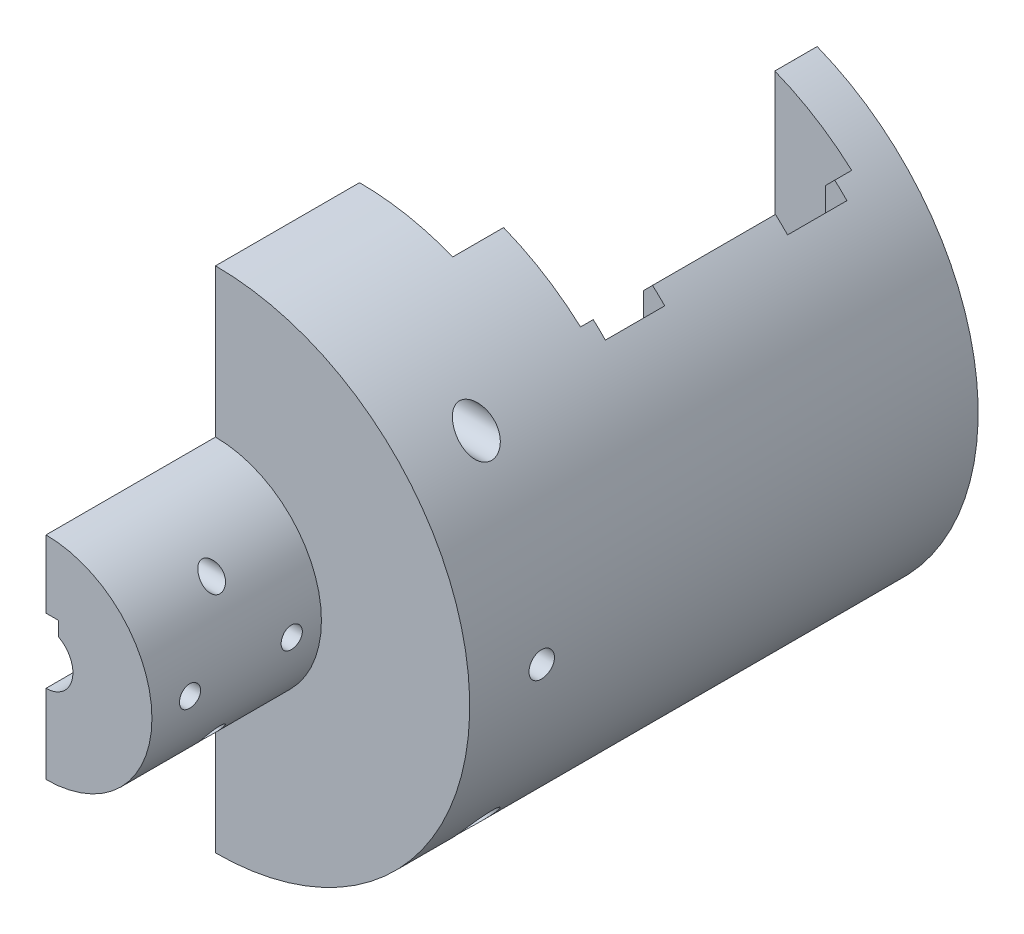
ISO-10303-21;
HEADER;
FILE_DESCRIPTION(('STEP AP214'),'2;1');
FILE_NAME('part.step','',(''),(''),'','','');
FILE_SCHEMA(('AUTOMOTIVE_DESIGN { 1 0 10303 214 1 1 1 1 }'));
ENDSEC;
DATA;
#1=APPLICATION_CONTEXT('core data for automotive mechanical design processes');
#2=APPLICATION_PROTOCOL_DEFINITION('international standard','automotive_design',2000,#1);
#3=PRODUCT_CONTEXT('',#1,'mechanical');
#4=PRODUCT('Part','Part','',(#3));
#5=PRODUCT_RELATED_PRODUCT_CATEGORY('part','',(#4));
#6=PRODUCT_DEFINITION_FORMATION('','',#4);
#7=PRODUCT_DEFINITION_CONTEXT('part definition',#1,'design');
#8=PRODUCT_DEFINITION('design','',#6,#7);
#9=PRODUCT_DEFINITION_SHAPE('','',#8);
#10=(LENGTH_UNIT() NAMED_UNIT(*) SI_UNIT(.MILLI.,.METRE.));
#11=(NAMED_UNIT(*) PLANE_ANGLE_UNIT() SI_UNIT($,.RADIAN.));
#12=(NAMED_UNIT(*) SI_UNIT($,.STERADIAN.) SOLID_ANGLE_UNIT());
#13=UNCERTAINTY_MEASURE_WITH_UNIT(LENGTH_MEASURE(1.E-05),#10,'distance_accuracy_value','');
#14=(GEOMETRIC_REPRESENTATION_CONTEXT(3) GLOBAL_UNCERTAINTY_ASSIGNED_CONTEXT((#13)) GLOBAL_UNIT_ASSIGNED_CONTEXT((#10,
#11,#12)) REPRESENTATION_CONTEXT('',''));
#15=CARTESIAN_POINT('',(0.,0.,0.));
#16=DIRECTION('',(0.,0.,1.));
#17=DIRECTION('',(1.,0.,0.));
#18=AXIS2_PLACEMENT_3D('',#15,#16,#17);
#19=CARTESIAN_POINT('',(186.199999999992,-59.8926546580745,-60.));
#20=DIRECTION('',(1.,0.,0.));
#21=DIRECTION('',(0.,0.,-1.));
#22=AXIS2_PLACEMENT_3D('',#19,#20,#21);
#23=PLANE('',#22);
#24=CARTESIAN_POINT('',(186.199999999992,-81.8926546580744,10.));
#25=DIRECTION('',(-1.,0.,0.));
#26=DIRECTION('',(0.,0.,1.));
#27=AXIS2_PLACEMENT_3D('',#24,#25,#26);
#28=CIRCLE('',#27,1.25);
#29=CARTESIAN_POINT('',(186.199999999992,-81.8926546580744,11.25));
#30=VERTEX_POINT('',#29);
#31=EDGE_CURVE('E407',#30,#30,#28,.T.);
#32=ORIENTED_EDGE('',*,*,#31,.F.);
#33=EDGE_LOOP('',(#32));
#34=FACE_BOUND('',#33,.T.);
#35=CARTESIAN_POINT('',(186.199999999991,-69.8926546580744,-8.5));
#36=DIRECTION('',(1.,0.,0.));
#37=DIRECTION('',(0.,0.,-1.));
#38=AXIS2_PLACEMENT_3D('',#35,#36,#37);
#39=CIRCLE('',#38,2.1);
#40=CARTESIAN_POINT('',(186.199999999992,-69.8926546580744,-10.6));
#41=VERTEX_POINT('',#40);
#42=EDGE_CURVE('E365',#41,#41,#39,.T.);
#43=ORIENTED_EDGE('',*,*,#42,.T.);
#44=EDGE_LOOP('',(#43));
#45=FACE_BOUND('',#44,.T.);
#46=DIRECTION('',(0.,1.,0.));
#47=VECTOR('',#46,1.);
#48=CARTESIAN_POINT('',(186.199999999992,-123.392654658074,-17.));
#49=LINE('',#48,#47);
#50=CARTESIAN_POINT('',(186.199999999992,-85.3926546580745,-17.));
#51=VERTEX_POINT('',#50);
#52=CARTESIAN_POINT('',(186.199999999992,-59.8926546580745,-17.));
#53=VERTEX_POINT('',#52);
#54=EDGE_CURVE('E250',#51,#53,#49,.T.);
#55=ORIENTED_EDGE('',*,*,#54,.F.);
#56=DIRECTION('',(0.,0.,-1.));
#57=VECTOR('',#56,1.);
#58=CARTESIAN_POINT('',(186.199999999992,-85.3926546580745,20.000025));
#59=LINE('',#58,#57);
#60=CARTESIAN_POINT('',(186.199999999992,-85.3926546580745,20.));
#61=VERTEX_POINT('',#60);
#62=EDGE_CURVE('E232',#61,#51,#59,.T.);
#63=ORIENTED_EDGE('',*,*,#62,.F.);
#64=DIRECTION('',(0.,-1.,0.));
#65=VECTOR('',#64,1.);
#66=CARTESIAN_POINT('',(186.199999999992,-102.392654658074,20.));
#67=LINE('',#66,#65);
#68=CARTESIAN_POINT('',(186.199999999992,-77.3926546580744,20.));
#69=VERTEX_POINT('',#68);
#70=EDGE_CURVE('E753',#69,#61,#67,.T.);
#71=ORIENTED_EDGE('',*,*,#70,.F.);
#72=DIRECTION('',(0.,0.,-1.));
#73=VECTOR('',#72,1.);
#74=CARTESIAN_POINT('',(186.199999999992,-77.3926546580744,20.));
#75=LINE('',#74,#73);
#76=CARTESIAN_POINT('',(186.199999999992,-77.3926546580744,0.));
#77=VERTEX_POINT('',#76);
#78=EDGE_CURVE('E411',#69,#77,#75,.T.);
#79=ORIENTED_EDGE('',*,*,#78,.T.);
#80=DIRECTION('',(0.,-1.,0.));
#81=VECTOR('',#80,1.);
#82=CARTESIAN_POINT('',(186.199999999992,0.,0.));
#83=LINE('',#82,#81);
#84=CARTESIAN_POINT('',(186.199999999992,-59.8926546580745,0.));
#85=VERTEX_POINT('',#84);
#86=EDGE_CURVE('E356',#85,#77,#83,.T.);
#87=ORIENTED_EDGE('',*,*,#86,.F.);
#88=DIRECTION('',(0.,0.,1.));
#89=VECTOR('',#88,1.);
#90=CARTESIAN_POINT('',(186.199999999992,-59.8926546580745,-60.));
#91=LINE('',#90,#89);
#92=EDGE_CURVE('E255',#53,#85,#91,.T.);
#93=ORIENTED_EDGE('',*,*,#92,.F.);
#94=EDGE_LOOP('',(#55,#63,#71,#79,#87,#93));
#95=FACE_BOUND('',#94,.T.);
#96=ADVANCED_FACE('F16',(#34,#45,#95),#23,.F.);
#97=CARTESIAN_POINT('',(197.199999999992,-123.392654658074,-23.));
#98=DIRECTION('',(1.,0.,0.));
#99=DIRECTION('',(0.,0.,-1.));
#100=AXIS2_PLACEMENT_3D('',#97,#98,#99);
#101=PLANE('',#100);
#102=DIRECTION('',(0.,0.,1.));
#103=VECTOR('',#102,1.);
#104=CARTESIAN_POINT('',(197.199999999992,-61.9820831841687,-60.));
#105=LINE('',#104,#103);
#106=CARTESIAN_POINT('',(197.199999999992,-61.9820831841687,-23.));
#107=VERTEX_POINT('',#106);
#108=CARTESIAN_POINT('',(197.199999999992,-61.9820831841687,-17.));
#109=VERTEX_POINT('',#108);
#110=EDGE_CURVE('E341',#107,#109,#105,.T.);
#111=ORIENTED_EDGE('',*,*,#110,.F.);
#112=DIRECTION('',(0.,1.,0.));
#113=VECTOR('',#112,1.);
#114=CARTESIAN_POINT('',(197.199999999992,-123.392654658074,-23.));
#115=LINE('',#114,#113);
#116=CARTESIAN_POINT('',(197.199999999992,-117.80322613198,-23.));
#117=VERTEX_POINT('',#116);
#118=EDGE_CURVE('E300',#117,#107,#115,.T.);
#119=ORIENTED_EDGE('',*,*,#118,.F.);
#120=DIRECTION('',(0.,0.,1.));
#121=VECTOR('',#120,1.);
#122=CARTESIAN_POINT('',(197.199999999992,-117.80322613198,-60.));
#123=LINE('',#122,#121);
#124=CARTESIAN_POINT('',(197.199999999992,-117.80322613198,-17.));
#125=VERTEX_POINT('',#124);
#126=EDGE_CURVE('E339',#125,#117,#123,.F.);
#127=ORIENTED_EDGE('',*,*,#126,.F.);
#128=DIRECTION('',(0.,1.,0.));
#129=VECTOR('',#128,1.);
#130=CARTESIAN_POINT('',(197.199999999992,-123.392654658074,-17.));
#131=LINE('',#130,#129);
#132=EDGE_CURVE('E299',#125,#109,#131,.T.);
#133=ORIENTED_EDGE('',*,*,#132,.T.);
#134=EDGE_LOOP('',(#111,#119,#127,#133));
#135=FACE_BOUND('',#134,.T.);
#136=ADVANCED_FACE('F396',(#135),#101,.F.);
#137=CARTESIAN_POINT('',(205.199999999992,-123.392654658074,-23.));
#138=DIRECTION('',(0.,0.,-1.));
#139=DIRECTION('',(-1.,0.,0.));
#140=AXIS2_PLACEMENT_3D('',#137,#138,#139);
#141=PLANE('',#140);
#142=ORIENTED_EDGE('',*,*,#118,.T.);
#143=CARTESIAN_POINT('',(186.199999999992,-89.8926546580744,-23.));
#144=DIRECTION('',(0.,0.,-1.));
#145=DIRECTION('',(-1.,0.,0.));
#146=AXIS2_PLACEMENT_3D('',#143,#144,#145);
#147=CIRCLE('',#146,30.);
#148=CARTESIAN_POINT('',(206.276050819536,-67.6002303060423,-23.));
#149=VERTEX_POINT('',#148);
#150=EDGE_CURVE('E274',#107,#149,#147,.T.);
#151=ORIENTED_EDGE('',*,*,#150,.T.);
#152=DIRECTION('',(0.707106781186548,0.707106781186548,0.));
#153=VECTOR('',#152,1.);
#154=CARTESIAN_POINT('',(206.276050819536,-67.6002303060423,-23.));
#155=LINE('',#154,#153);
#156=CARTESIAN_POINT('',(205.199999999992,-68.6762811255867,-23.));
#157=VERTEX_POINT('',#156);
#158=EDGE_CURVE('E444',#149,#157,#155,.F.);
#159=ORIENTED_EDGE('',*,*,#158,.T.);
#160=DIRECTION('',(0.,1.,0.));
#161=VECTOR('',#160,1.);
#162=CARTESIAN_POINT('',(205.199999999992,-123.392654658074,-23.));
#163=LINE('',#162,#161);
#164=CARTESIAN_POINT('',(205.199999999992,-111.109028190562,-23.));
#165=VERTEX_POINT('',#164);
#166=EDGE_CURVE('E336',#165,#157,#163,.T.);
#167=ORIENTED_EDGE('',*,*,#166,.F.);
#168=DIRECTION('',(0.707106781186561,-0.707106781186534,0.));
#169=VECTOR('',#168,1.);
#170=CARTESIAN_POINT('',(206.276050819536,-112.185079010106,-23.));
#171=LINE('',#170,#169);
#172=CARTESIAN_POINT('',(206.276050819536,-112.185079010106,-23.));
#173=VERTEX_POINT('',#172);
#174=EDGE_CURVE('E504',#165,#173,#171,.T.);
#175=ORIENTED_EDGE('',*,*,#174,.T.);
#176=EDGE_CURVE('E268',#173,#117,#147,.T.);
#177=ORIENTED_EDGE('',*,*,#176,.T.);
#178=EDGE_LOOP('',(#142,#151,#159,#167,#175,#177));
#179=FACE_BOUND('',#178,.T.);
#180=ADVANCED_FACE('F402',(#179),#141,.T.);
#181=CARTESIAN_POINT('',(167.199999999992,-123.392654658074,-17.));
#182=DIRECTION('',(0.,0.,1.));
#183=DIRECTION('',(1.,0.,0.));
#184=AXIS2_PLACEMENT_3D('',#181,#182,#183);
#185=PLANE('',#184);
#186=CARTESIAN_POINT('',(186.199999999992,-89.8926546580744,-17.));
#187=DIRECTION('',(0.,0.,1.));
#188=DIRECTION('',(1.,0.,0.));
#189=AXIS2_PLACEMENT_3D('',#186,#187,#188);
#190=CIRCLE('',#189,3.175);
#191=CARTESIAN_POINT('',(186.199999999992,-93.0676546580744,-17.));
#192=VERTEX_POINT('',#191);
#193=CARTESIAN_POINT('',(187.7,-87.0943292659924,-17.));
#194=VERTEX_POINT('',#193);
#195=EDGE_CURVE('E742',#192,#194,#190,.T.);
#196=ORIENTED_EDGE('',*,*,#195,.T.);
#197=DIRECTION('',(0.,-1.,0.));
#198=VECTOR('',#197,1.);
#199=CARTESIAN_POINT('',(187.7,-85.3926546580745,-17.));
#200=LINE('',#199,#198);
#201=CARTESIAN_POINT('',(187.7,-85.3926546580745,-17.));
#202=VERTEX_POINT('',#201);
#203=EDGE_CURVE('E244',#202,#194,#200,.T.);
#204=ORIENTED_EDGE('',*,*,#203,.F.);
#205=DIRECTION('',(1.,0.,0.));
#206=VECTOR('',#205,1.);
#207=CARTESIAN_POINT('',(186.199999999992,-85.3926546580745,-17.));
#208=LINE('',#207,#206);
#209=EDGE_CURVE('E236',#51,#202,#208,.T.);
#210=ORIENTED_EDGE('',*,*,#209,.F.);
#211=ORIENTED_EDGE('',*,*,#54,.T.);
#212=CARTESIAN_POINT('',(186.199999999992,-89.8926546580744,-17.));
#213=DIRECTION('',(0.,0.,1.));
#214=DIRECTION('',(1.,0.,0.));
#215=AXIS2_PLACEMENT_3D('',#212,#213,#214);
#216=CIRCLE('',#215,30.);
#217=EDGE_CURVE('E277',#109,#53,#216,.T.);
#218=ORIENTED_EDGE('',*,*,#217,.F.);
#219=ORIENTED_EDGE('',*,*,#132,.F.);
#220=CARTESIAN_POINT('',(186.199999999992,-119.892654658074,-17.));
#221=VERTEX_POINT('',#220);
#222=EDGE_CURVE('E273',#221,#125,#216,.T.);
#223=ORIENTED_EDGE('',*,*,#222,.F.);
#224=EDGE_CURVE('E257',#221,#192,#49,.T.);
#225=ORIENTED_EDGE('',*,*,#224,.T.);
#226=EDGE_LOOP('',(#196,#204,#210,#211,#218,#219,#223,#225));
#227=FACE_BOUND('',#226,.T.);
#228=ADVANCED_FACE('F248',(#227),#185,.F.);
#229=CARTESIAN_POINT('',(205.199999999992,-123.392654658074,-24.5));
#230=DIRECTION('',(0.,0.,1.));
#231=DIRECTION('',(1.,0.,0.));
#232=AXIS2_PLACEMENT_3D('',#229,#230,#231);
#233=PLANE('',#232);
#234=DIRECTION('',(0.,1.,0.));
#235=VECTOR('',#234,1.);
#236=CARTESIAN_POINT('',(205.199999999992,-123.392654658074,-24.5));
#237=LINE('',#236,#235);
#238=CARTESIAN_POINT('',(205.199999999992,-111.109028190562,-24.5));
#239=VERTEX_POINT('',#238);
#240=CARTESIAN_POINT('',(205.199999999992,-68.6762811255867,-24.5));
#241=VERTEX_POINT('',#240);
#242=EDGE_CURVE('E314',#239,#241,#237,.T.);
#243=ORIENTED_EDGE('',*,*,#242,.T.);
#244=DIRECTION('',(-0.707106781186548,-0.707106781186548,0.));
#245=VECTOR('',#244,1.);
#246=CARTESIAN_POINT('',(206.276050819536,-67.6002303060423,-24.5));
#247=LINE('',#246,#245);
#248=CARTESIAN_POINT('',(206.276050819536,-67.6002303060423,-24.5));
#249=VERTEX_POINT('',#248);
#250=EDGE_CURVE('E443',#241,#249,#247,.F.);
#251=ORIENTED_EDGE('',*,*,#250,.T.);
#252=CARTESIAN_POINT('',(186.199999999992,-89.8926546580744,-24.5));
#253=DIRECTION('',(0.,0.,1.));
#254=DIRECTION('',(1.,0.,0.));
#255=AXIS2_PLACEMENT_3D('',#252,#253,#254);
#256=CIRCLE('',#255,30.);
#257=CARTESIAN_POINT('',(207.70950649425,-68.979952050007,-24.5));
#258=VERTEX_POINT('',#257);
#259=EDGE_CURVE('E280',#258,#249,#256,.T.);
#260=ORIENTED_EDGE('',*,*,#259,.F.);
#261=DIRECTION('',(0.707106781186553,0.707106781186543,0.));
#262=VECTOR('',#261,1.);
#263=CARTESIAN_POINT('',(179.248401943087,-97.4410566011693,-24.5));
#264=LINE('',#263,#262);
#265=CARTESIAN_POINT('',(206.699999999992,-69.989458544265,-24.5));
#266=VERTEX_POINT('',#265);
#267=EDGE_CURVE('E485',#258,#266,#264,.F.);
#268=ORIENTED_EDGE('',*,*,#267,.T.);
#269=DIRECTION('',(0.,1.,0.));
#270=VECTOR('',#269,1.);
#271=CARTESIAN_POINT('',(206.699999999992,-123.392654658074,-24.5));
#272=LINE('',#271,#270);
#273=CARTESIAN_POINT('',(206.699999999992,-109.795850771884,-24.5));
#274=VERTEX_POINT('',#273);
#275=EDGE_CURVE('E330',#274,#266,#272,.T.);
#276=ORIENTED_EDGE('',*,*,#275,.F.);
#277=DIRECTION('',(0.707106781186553,-0.707106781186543,0.));
#278=VECTOR('',#277,1.);
#279=CARTESIAN_POINT('',(212.748401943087,-115.844252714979,-24.5));
#280=LINE('',#279,#278);
#281=CARTESIAN_POINT('',(207.70950649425,-110.805357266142,-24.5));
#282=VERTEX_POINT('',#281);
#283=EDGE_CURVE('E11',#274,#282,#280,.T.);
#284=ORIENTED_EDGE('',*,*,#283,.T.);
#285=CARTESIAN_POINT('',(206.276050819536,-112.185079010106,-24.5));
#286=VERTEX_POINT('',#285);
#287=EDGE_CURVE('E276',#286,#282,#256,.T.);
#288=ORIENTED_EDGE('',*,*,#287,.F.);
#289=DIRECTION('',(-0.707106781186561,0.707106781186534,0.));
#290=VECTOR('',#289,1.);
#291=CARTESIAN_POINT('',(206.276050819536,-112.185079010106,-24.5));
#292=LINE('',#291,#290);
#293=EDGE_CURVE('E454',#286,#239,#292,.T.);
#294=ORIENTED_EDGE('',*,*,#293,.T.);
#295=EDGE_LOOP('',(#243,#251,#260,#268,#276,#284,#288,#294));
#296=FACE_BOUND('',#295,.T.);
#297=ADVANCED_FACE('F525',(#296),#233,.F.);
#298=CARTESIAN_POINT('',(206.699999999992,-123.392654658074,-24.5));
#299=DIRECTION('',(1.,0.,0.));
#300=DIRECTION('',(0.,0.,-1.));
#301=AXIS2_PLACEMENT_3D('',#298,#299,#300);
#302=PLANE('',#301);
#303=ORIENTED_EDGE('',*,*,#275,.T.);
#304=DIRECTION('',(0.,0.,-1.));
#305=VECTOR('',#304,1.);
#306=CARTESIAN_POINT('',(206.699999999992,-69.989458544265,-31.5));
#307=LINE('',#306,#305);
#308=CARTESIAN_POINT('',(206.699999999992,-69.989458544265,-31.5));
#309=VERTEX_POINT('',#308);
#310=EDGE_CURVE('E459',#266,#309,#307,.T.);
#311=ORIENTED_EDGE('',*,*,#310,.T.);
#312=DIRECTION('',(0.,1.,0.));
#313=VECTOR('',#312,1.);
#314=CARTESIAN_POINT('',(206.699999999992,-123.392654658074,-31.5));
#315=LINE('',#314,#313);
#316=CARTESIAN_POINT('',(206.699999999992,-109.795850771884,-31.5));
#317=VERTEX_POINT('',#316);
#318=EDGE_CURVE('E327',#317,#309,#315,.T.);
#319=ORIENTED_EDGE('',*,*,#318,.F.);
#320=DIRECTION('',(0.,0.,1.));
#321=VECTOR('',#320,1.);
#322=CARTESIAN_POINT('',(206.699999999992,-109.795850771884,-24.5));
#323=LINE('',#322,#321);
#324=EDGE_CURVE('E457',#317,#274,#323,.T.);
#325=ORIENTED_EDGE('',*,*,#324,.T.);
#326=EDGE_LOOP('',(#303,#311,#319,#325));
#327=FACE_BOUND('',#326,.T.);
#328=ADVANCED_FACE('F518',(#327),#302,.F.);
#329=CARTESIAN_POINT('',(205.199999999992,-123.392654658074,-31.5));
#330=DIRECTION('',(0.,0.,-1.));
#331=DIRECTION('',(-1.,0.,0.));
#332=AXIS2_PLACEMENT_3D('',#329,#330,#331);
#333=PLANE('',#332);
#334=CARTESIAN_POINT('',(186.199999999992,-89.8926546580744,-31.5));
#335=DIRECTION('',(0.,0.,-1.));
#336=DIRECTION('',(-1.,0.,0.));
#337=AXIS2_PLACEMENT_3D('',#334,#335,#336);
#338=CIRCLE('',#337,30.);
#339=CARTESIAN_POINT('',(206.276050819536,-67.6002303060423,-31.5));
#340=VERTEX_POINT('',#339);
#341=CARTESIAN_POINT('',(207.70950649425,-68.979952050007,-31.5));
#342=VERTEX_POINT('',#341);
#343=EDGE_CURVE('E284',#340,#342,#338,.T.);
#344=ORIENTED_EDGE('',*,*,#343,.F.);
#345=DIRECTION('',(0.707106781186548,0.707106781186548,0.));
#346=VECTOR('',#345,1.);
#347=CARTESIAN_POINT('',(206.276050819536,-67.6002303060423,-31.5));
#348=LINE('',#347,#346);
#349=CARTESIAN_POINT('',(205.199999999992,-68.6762811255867,-31.5));
#350=VERTEX_POINT('',#349);
#351=EDGE_CURVE('E463',#340,#350,#348,.F.);
#352=ORIENTED_EDGE('',*,*,#351,.T.);
#353=DIRECTION('',(0.,1.,0.));
#354=VECTOR('',#353,1.);
#355=CARTESIAN_POINT('',(205.199999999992,-123.392654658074,-31.5));
#356=LINE('',#355,#354);
#357=CARTESIAN_POINT('',(205.199999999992,-111.109028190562,-31.5));
#358=VERTEX_POINT('',#357);
#359=EDGE_CURVE('E323',#358,#350,#356,.T.);
#360=ORIENTED_EDGE('',*,*,#359,.F.);
#361=DIRECTION('',(0.707106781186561,-0.707106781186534,0.));
#362=VECTOR('',#361,1.);
#363=CARTESIAN_POINT('',(206.276050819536,-112.185079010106,-31.5));
#364=LINE('',#363,#362);
#365=CARTESIAN_POINT('',(206.276050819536,-112.185079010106,-31.5));
#366=VERTEX_POINT('',#365);
#367=EDGE_CURVE('E461',#358,#366,#364,.T.);
#368=ORIENTED_EDGE('',*,*,#367,.T.);
#369=CARTESIAN_POINT('',(207.70950649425,-110.805357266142,-31.5));
#370=VERTEX_POINT('',#369);
#371=EDGE_CURVE('E279',#370,#366,#338,.T.);
#372=ORIENTED_EDGE('',*,*,#371,.F.);
#373=DIRECTION('',(-0.707106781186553,0.707106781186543,0.));
#374=VECTOR('',#373,1.);
#375=CARTESIAN_POINT('',(212.748401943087,-115.844252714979,-31.5));
#376=LINE('',#375,#374);
#377=EDGE_CURVE('E30',#370,#317,#376,.T.);
#378=ORIENTED_EDGE('',*,*,#377,.T.);
#379=ORIENTED_EDGE('',*,*,#318,.T.);
#380=DIRECTION('',(-0.707106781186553,-0.707106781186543,0.));
#381=VECTOR('',#380,1.);
#382=CARTESIAN_POINT('',(179.248401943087,-97.4410566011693,-31.5));
#383=LINE('',#382,#381);
#384=EDGE_CURVE('E487',#309,#342,#383,.F.);
#385=ORIENTED_EDGE('',*,*,#384,.T.);
#386=EDGE_LOOP('',(#344,#352,#360,#368,#372,#378,#379,#385));
#387=FACE_BOUND('',#386,.T.);
#388=ADVANCED_FACE('F511',(#387),#333,.F.);
#389=CARTESIAN_POINT('',(205.199999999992,-123.392654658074,-60.));
#390=DIRECTION('',(1.,0.,0.));
#391=DIRECTION('',(0.,0.,-1.));
#392=AXIS2_PLACEMENT_3D('',#389,#390,#391);
#393=PLANE('',#392);
#394=ORIENTED_EDGE('',*,*,#166,.T.);
#395=DIRECTION('',(0.,0.,-1.));
#396=VECTOR('',#395,1.);
#397=CARTESIAN_POINT('',(205.199999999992,-68.6762811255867,-24.5));
#398=LINE('',#397,#396);
#399=EDGE_CURVE('E447',#157,#241,#398,.T.);
#400=ORIENTED_EDGE('',*,*,#399,.T.);
#401=ORIENTED_EDGE('',*,*,#242,.F.);
#402=DIRECTION('',(0.,0.,1.));
#403=VECTOR('',#402,1.);
#404=CARTESIAN_POINT('',(205.199999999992,-111.109028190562,-23.));
#405=LINE('',#404,#403);
#406=EDGE_CURVE('E445',#239,#165,#405,.T.);
#407=ORIENTED_EDGE('',*,*,#406,.T.);
#408=EDGE_LOOP('',(#394,#400,#401,#407));
#409=FACE_BOUND('',#408,.T.);
#410=ADVANCED_FACE('F915',(#409),#393,.F.);
#411=CARTESIAN_POINT('',(205.199999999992,-123.392654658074,-46.));
#412=DIRECTION('',(0.,0.,1.));
#413=DIRECTION('',(1.,0.,0.));
#414=AXIS2_PLACEMENT_3D('',#411,#412,#413);
#415=PLANE('',#414);
#416=DIRECTION('',(0.,1.,0.));
#417=VECTOR('',#416,1.);
#418=CARTESIAN_POINT('',(205.199999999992,-123.392654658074,-46.));
#419=LINE('',#418,#417);
#420=CARTESIAN_POINT('',(205.199999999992,-111.109028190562,-46.));
#421=VERTEX_POINT('',#420);
#422=CARTESIAN_POINT('',(205.199999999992,-68.6762811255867,-46.));
#423=VERTEX_POINT('',#422);
#424=EDGE_CURVE('E309',#421,#423,#419,.T.);
#425=ORIENTED_EDGE('',*,*,#424,.T.);
#426=DIRECTION('',(-0.707106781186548,-0.707106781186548,0.));
#427=VECTOR('',#426,1.);
#428=CARTESIAN_POINT('',(206.276050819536,-67.6002303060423,-46.));
#429=LINE('',#428,#427);
#430=CARTESIAN_POINT('',(206.276050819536,-67.6002303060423,-46.));
#431=VERTEX_POINT('',#430);
#432=EDGE_CURVE('E471',#423,#431,#429,.F.);
#433=ORIENTED_EDGE('',*,*,#432,.T.);
#434=CARTESIAN_POINT('',(186.199999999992,-89.8926546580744,-46.));
#435=DIRECTION('',(0.,0.,1.));
#436=DIRECTION('',(1.,0.,0.));
#437=AXIS2_PLACEMENT_3D('',#434,#435,#436);
#438=CIRCLE('',#437,30.);
#439=CARTESIAN_POINT('',(207.70950649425,-68.979952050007,-46.));
#440=VERTEX_POINT('',#439);
#441=EDGE_CURVE('E287',#440,#431,#438,.T.);
#442=ORIENTED_EDGE('',*,*,#441,.F.);
#443=DIRECTION('',(0.707106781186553,0.707106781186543,0.));
#444=VECTOR('',#443,1.);
#445=CARTESIAN_POINT('',(179.248401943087,-97.4410566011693,-46.));
#446=LINE('',#445,#444);
#447=CARTESIAN_POINT('',(206.699999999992,-69.989458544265,-46.));
#448=VERTEX_POINT('',#447);
#449=EDGE_CURVE('E490',#440,#448,#446,.F.);
#450=ORIENTED_EDGE('',*,*,#449,.T.);
#451=DIRECTION('',(0.,1.,0.));
#452=VECTOR('',#451,1.);
#453=CARTESIAN_POINT('',(206.699999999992,-123.392654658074,-46.));
#454=LINE('',#453,#452);
#455=CARTESIAN_POINT('',(206.699999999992,-109.795850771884,-46.));
#456=VERTEX_POINT('',#455);
#457=EDGE_CURVE('E318',#456,#448,#454,.T.);
#458=ORIENTED_EDGE('',*,*,#457,.F.);
#459=DIRECTION('',(0.707106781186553,-0.707106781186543,0.));
#460=VECTOR('',#459,1.);
#461=CARTESIAN_POINT('',(212.748401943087,-115.844252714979,-46.));
#462=LINE('',#461,#460);
#463=CARTESIAN_POINT('',(207.70950649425,-110.805357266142,-46.));
#464=VERTEX_POINT('',#463);
#465=EDGE_CURVE('E501',#456,#464,#462,.T.);
#466=ORIENTED_EDGE('',*,*,#465,.T.);
#467=CARTESIAN_POINT('',(206.276050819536,-112.185079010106,-46.));
#468=VERTEX_POINT('',#467);
#469=EDGE_CURVE('E283',#468,#464,#438,.T.);
#470=ORIENTED_EDGE('',*,*,#469,.F.);
#471=DIRECTION('',(-0.707106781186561,0.707106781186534,0.));
#472=VECTOR('',#471,1.);
#473=CARTESIAN_POINT('',(206.276050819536,-112.185079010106,-46.));
#474=LINE('',#473,#472);
#475=EDGE_CURVE('E469',#468,#421,#474,.T.);
#476=ORIENTED_EDGE('',*,*,#475,.T.);
#477=EDGE_LOOP('',(#425,#433,#442,#450,#458,#466,#470,#476));
#478=FACE_BOUND('',#477,.T.);
#479=ADVANCED_FACE('F573',(#478),#415,.F.);
#480=CARTESIAN_POINT('',(206.699999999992,-123.392654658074,-46.));
#481=DIRECTION('',(1.,0.,0.));
#482=DIRECTION('',(0.,0.,-1.));
#483=AXIS2_PLACEMENT_3D('',#480,#481,#482);
#484=PLANE('',#483);
#485=ORIENTED_EDGE('',*,*,#457,.T.);
#486=DIRECTION('',(0.,0.,-1.));
#487=VECTOR('',#486,1.);
#488=CARTESIAN_POINT('',(206.699999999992,-69.989458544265,-53.));
#489=LINE('',#488,#487);
#490=CARTESIAN_POINT('',(206.699999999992,-69.989458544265,-53.));
#491=VERTEX_POINT('',#490);
#492=EDGE_CURVE('E475',#448,#491,#489,.T.);
#493=ORIENTED_EDGE('',*,*,#492,.T.);
#494=DIRECTION('',(0.,1.,0.));
#495=VECTOR('',#494,1.);
#496=CARTESIAN_POINT('',(206.699999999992,-123.392654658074,-53.));
#497=LINE('',#496,#495);
#498=CARTESIAN_POINT('',(206.699999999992,-109.795850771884,-53.));
#499=VERTEX_POINT('',#498);
#500=EDGE_CURVE('E315',#499,#491,#497,.T.);
#501=ORIENTED_EDGE('',*,*,#500,.F.);
#502=DIRECTION('',(0.,0.,1.));
#503=VECTOR('',#502,1.);
#504=CARTESIAN_POINT('',(206.699999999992,-109.795850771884,-46.));
#505=LINE('',#504,#503);
#506=EDGE_CURVE('E473',#499,#456,#505,.T.);
#507=ORIENTED_EDGE('',*,*,#506,.T.);
#508=EDGE_LOOP('',(#485,#493,#501,#507));
#509=FACE_BOUND('',#508,.T.);
#510=ADVANCED_FACE('F604',(#509),#484,.F.);
#511=CARTESIAN_POINT('',(205.199999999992,-123.392654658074,-53.));
#512=DIRECTION('',(0.,0.,-1.));
#513=DIRECTION('',(-1.,0.,0.));
#514=AXIS2_PLACEMENT_3D('',#511,#512,#513);
#515=PLANE('',#514);
#516=CARTESIAN_POINT('',(186.199999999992,-89.8926546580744,-53.));
#517=DIRECTION('',(0.,0.,-1.));
#518=DIRECTION('',(-1.,0.,0.));
#519=AXIS2_PLACEMENT_3D('',#516,#517,#518);
#520=CIRCLE('',#519,30.);
#521=CARTESIAN_POINT('',(206.276050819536,-67.6002303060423,-53.));
#522=VERTEX_POINT('',#521);
#523=CARTESIAN_POINT('',(207.70950649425,-68.979952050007,-53.));
#524=VERTEX_POINT('',#523);
#525=EDGE_CURVE('E291',#522,#524,#520,.T.);
#526=ORIENTED_EDGE('',*,*,#525,.F.);
#527=DIRECTION('',(0.707106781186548,0.707106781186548,0.));
#528=VECTOR('',#527,1.);
#529=CARTESIAN_POINT('',(206.276050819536,-67.6002303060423,-53.));
#530=LINE('',#529,#528);
#531=CARTESIAN_POINT('',(205.199999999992,-68.6762811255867,-53.));
#532=VERTEX_POINT('',#531);
#533=EDGE_CURVE('E479',#522,#532,#530,.F.);
#534=ORIENTED_EDGE('',*,*,#533,.T.);
#535=DIRECTION('',(0.,1.,0.));
#536=VECTOR('',#535,1.);
#537=CARTESIAN_POINT('',(205.199999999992,-123.392654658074,-53.));
#538=LINE('',#537,#536);
#539=CARTESIAN_POINT('',(205.199999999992,-111.109028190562,-53.));
#540=VERTEX_POINT('',#539);
#541=EDGE_CURVE('E312',#540,#532,#538,.T.);
#542=ORIENTED_EDGE('',*,*,#541,.F.);
#543=DIRECTION('',(0.707106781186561,-0.707106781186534,0.));
#544=VECTOR('',#543,1.);
#545=CARTESIAN_POINT('',(206.276050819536,-112.185079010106,-53.));
#546=LINE('',#545,#544);
#547=CARTESIAN_POINT('',(206.276050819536,-112.185079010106,-53.));
#548=VERTEX_POINT('',#547);
#549=EDGE_CURVE('E477',#540,#548,#546,.T.);
#550=ORIENTED_EDGE('',*,*,#549,.T.);
#551=CARTESIAN_POINT('',(207.70950649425,-110.805357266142,-53.));
#552=VERTEX_POINT('',#551);
#553=EDGE_CURVE('E286',#552,#548,#520,.T.);
#554=ORIENTED_EDGE('',*,*,#553,.F.);
#555=DIRECTION('',(-0.707106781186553,0.707106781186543,0.));
#556=VECTOR('',#555,1.);
#557=CARTESIAN_POINT('',(212.748401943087,-115.844252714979,-53.));
#558=LINE('',#557,#556);
#559=EDGE_CURVE('E499',#552,#499,#558,.T.);
#560=ORIENTED_EDGE('',*,*,#559,.T.);
#561=ORIENTED_EDGE('',*,*,#500,.T.);
#562=DIRECTION('',(-0.707106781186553,-0.707106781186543,0.));
#563=VECTOR('',#562,1.);
#564=CARTESIAN_POINT('',(179.248401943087,-97.4410566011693,-53.));
#565=LINE('',#564,#563);
#566=EDGE_CURVE('E492',#491,#524,#565,.F.);
#567=ORIENTED_EDGE('',*,*,#566,.T.);
#568=EDGE_LOOP('',(#526,#534,#542,#550,#554,#560,#561,#567));
#569=FACE_BOUND('',#568,.T.);
#570=ADVANCED_FACE('F554',(#569),#515,.F.);
#571=ORIENTED_EDGE('',*,*,#359,.T.);
#572=DIRECTION('',(0.,0.,-1.));
#573=VECTOR('',#572,1.);
#574=CARTESIAN_POINT('',(205.199999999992,-68.6762811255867,-46.));
#575=LINE('',#574,#573);
#576=EDGE_CURVE('E467',#350,#423,#575,.T.);
#577=ORIENTED_EDGE('',*,*,#576,.T.);
#578=ORIENTED_EDGE('',*,*,#424,.F.);
#579=DIRECTION('',(0.,0.,1.));
#580=VECTOR('',#579,1.);
#581=CARTESIAN_POINT('',(205.199999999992,-111.109028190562,-31.5));
#582=LINE('',#581,#580);
#583=EDGE_CURVE('E465',#421,#358,#582,.T.);
#584=ORIENTED_EDGE('',*,*,#583,.T.);
#585=EDGE_LOOP('',(#571,#577,#578,#584));
#586=FACE_BOUND('',#585,.T.);
#587=ADVANCED_FACE('F570',(#586),#393,.F.);
#588=CARTESIAN_POINT('',(197.199999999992,-123.392654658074,-60.));
#589=DIRECTION('',(1.,0.,0.));
#590=DIRECTION('',(0.,0.,-1.));
#591=AXIS2_PLACEMENT_3D('',#588,#589,#590);
#592=PLANE('',#591);
#593=DIRECTION('',(0.,0.,1.));
#594=VECTOR('',#593,1.);
#595=CARTESIAN_POINT('',(197.199999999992,-61.9820831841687,-60.));
#596=LINE('',#595,#594);
#597=CARTESIAN_POINT('',(197.199999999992,-61.9820831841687,-60.));
#598=VERTEX_POINT('',#597);
#599=CARTESIAN_POINT('',(197.199999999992,-61.9820831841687,-55.));
#600=VERTEX_POINT('',#599);
#601=EDGE_CURVE('E297',#598,#600,#596,.T.);
#602=ORIENTED_EDGE('',*,*,#601,.F.);
#603=DIRECTION('',(0.,1.,0.));
#604=VECTOR('',#603,1.);
#605=CARTESIAN_POINT('',(197.199999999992,-123.392654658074,-60.));
#606=LINE('',#605,#604);
#607=CARTESIAN_POINT('',(197.199999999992,-117.80322613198,-60.));
#608=VERTEX_POINT('',#607);
#609=EDGE_CURVE('E306',#608,#598,#606,.T.);
#610=ORIENTED_EDGE('',*,*,#609,.F.);
#611=DIRECTION('',(0.,0.,1.));
#612=VECTOR('',#611,1.);
#613=CARTESIAN_POINT('',(197.199999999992,-117.80322613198,-60.));
#614=LINE('',#613,#612);
#615=CARTESIAN_POINT('',(197.199999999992,-117.80322613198,-55.));
#616=VERTEX_POINT('',#615);
#617=EDGE_CURVE('E293',#616,#608,#614,.F.);
#618=ORIENTED_EDGE('',*,*,#617,.F.);
#619=DIRECTION('',(0.,1.,0.));
#620=VECTOR('',#619,1.);
#621=CARTESIAN_POINT('',(197.199999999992,-123.392654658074,-55.));
#622=LINE('',#621,#620);
#623=EDGE_CURVE('E303',#616,#600,#622,.T.);
#624=ORIENTED_EDGE('',*,*,#623,.T.);
#625=EDGE_LOOP('',(#602,#610,#618,#624));
#626=FACE_BOUND('',#625,.T.);
#627=ADVANCED_FACE('F543',(#626),#592,.F.);
#628=CARTESIAN_POINT('',(205.199999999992,-123.392654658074,-55.));
#629=DIRECTION('',(0.,0.,1.));
#630=DIRECTION('',(1.,0.,0.));
#631=AXIS2_PLACEMENT_3D('',#628,#629,#630);
#632=PLANE('',#631);
#633=CARTESIAN_POINT('',(186.199999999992,-89.8926546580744,-55.));
#634=DIRECTION('',(0.,0.,1.));
#635=DIRECTION('',(1.,0.,0.));
#636=AXIS2_PLACEMENT_3D('',#633,#634,#635);
#637=CIRCLE('',#636,30.);
#638=CARTESIAN_POINT('',(206.276050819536,-112.185079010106,-55.));
#639=VERTEX_POINT('',#638);
#640=EDGE_CURVE('E290',#616,#639,#637,.T.);
#641=ORIENTED_EDGE('',*,*,#640,.T.);
#642=DIRECTION('',(-0.707106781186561,0.707106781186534,0.));
#643=VECTOR('',#642,1.);
#644=CARTESIAN_POINT('',(206.276050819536,-112.185079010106,-55.));
#645=LINE('',#644,#643);
#646=CARTESIAN_POINT('',(205.199999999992,-111.109028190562,-55.));
#647=VERTEX_POINT('',#646);
#648=EDGE_CURVE('E44',#639,#647,#645,.T.);
#649=ORIENTED_EDGE('',*,*,#648,.T.);
#650=DIRECTION('',(0.,1.,0.));
#651=VECTOR('',#650,1.);
#652=CARTESIAN_POINT('',(205.199999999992,-123.392654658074,-55.));
#653=LINE('',#652,#651);
#654=CARTESIAN_POINT('',(205.199999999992,-68.6762811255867,-55.));
#655=VERTEX_POINT('',#654);
#656=EDGE_CURVE('E326',#647,#655,#653,.T.);
#657=ORIENTED_EDGE('',*,*,#656,.T.);
#658=DIRECTION('',(-0.707106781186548,-0.707106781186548,0.));
#659=VECTOR('',#658,1.);
#660=CARTESIAN_POINT('',(206.276050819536,-67.6002303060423,-55.));
#661=LINE('',#660,#659);
#662=CARTESIAN_POINT('',(206.276050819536,-67.6002303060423,-55.));
#663=VERTEX_POINT('',#662);
#664=EDGE_CURVE('E495',#655,#663,#661,.F.);
#665=ORIENTED_EDGE('',*,*,#664,.T.);
#666=EDGE_CURVE('E294',#663,#600,#637,.T.);
#667=ORIENTED_EDGE('',*,*,#666,.T.);
#668=ORIENTED_EDGE('',*,*,#623,.F.);
#669=EDGE_LOOP('',(#641,#649,#657,#665,#667,#668));
#670=FACE_BOUND('',#669,.T.);
#671=ADVANCED_FACE('F537',(#670),#632,.T.);
#672=CARTESIAN_POINT('',(0.,0.,-60.));
#673=DIRECTION('',(0.,0.,-1.));
#674=DIRECTION('',(-1.,0.,0.));
#675=AXIS2_PLACEMENT_3D('',#672,#673,#674);
#676=PLANE('',#675);
#677=ORIENTED_EDGE('',*,*,#609,.T.);
#678=CARTESIAN_POINT('',(186.199999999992,-89.8926546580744,-60.));
#679=DIRECTION('',(0.,0.,1.));
#680=DIRECTION('',(1.,0.,0.));
#681=AXIS2_PLACEMENT_3D('',#678,#679,#680);
#682=CIRCLE('',#681,30.);
#683=EDGE_CURVE('E266',#608,#598,#682,.T.);
#684=ORIENTED_EDGE('',*,*,#683,.F.);
#685=EDGE_LOOP('',(#677,#684));
#686=FACE_BOUND('',#685,.T.);
#687=ADVANCED_FACE('F958',(#686),#676,.T.);
#688=ORIENTED_EDGE('',*,*,#541,.T.);
#689=DIRECTION('',(0.,0.,-1.));
#690=VECTOR('',#689,1.);
#691=CARTESIAN_POINT('',(205.199999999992,-68.6762811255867,-55.));
#692=LINE('',#691,#690);
#693=EDGE_CURVE('E37',#532,#655,#692,.T.);
#694=ORIENTED_EDGE('',*,*,#693,.T.);
#695=ORIENTED_EDGE('',*,*,#656,.F.);
#696=DIRECTION('',(0.,0.,1.));
#697=VECTOR('',#696,1.);
#698=CARTESIAN_POINT('',(205.199999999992,-111.109028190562,-53.));
#699=LINE('',#698,#697);
#700=EDGE_CURVE('E481',#647,#540,#699,.T.);
#701=ORIENTED_EDGE('',*,*,#700,.T.);
#702=EDGE_LOOP('',(#688,#694,#695,#701));
#703=FACE_BOUND('',#702,.T.);
#704=ADVANCED_FACE('F427',(#703),#393,.F.);
#705=CARTESIAN_POINT('',(186.199999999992,-89.8926546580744,-60.));
#706=DIRECTION('',(0.,0.,1.));
#707=DIRECTION('',(1.,0.,0.));
#708=AXIS2_PLACEMENT_3D('',#705,#706,#707);
#709=CYLINDRICAL_SURFACE('',#708,30.);
#710=CARTESIAN_POINT('',(216.199999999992,-89.8926546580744,-9.99999999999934));
#711=CARTESIAN_POINT('',(216.199999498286,-89.8084554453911,-9.99999628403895));
#712=CARTESIAN_POINT('',(216.199641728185,-89.7241965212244,-9.99288668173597));
#713=CARTESIAN_POINT('',(216.198248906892,-89.5580030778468,-9.96462589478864));
#714=CARTESIAN_POINT('',(216.197213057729,-89.4760714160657,-9.94345816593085));
#715=CARTESIAN_POINT('',(216.194581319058,-89.3169640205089,-9.88768869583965));
#716=CARTESIAN_POINT('',(216.192985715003,-89.2397858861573,-9.8530938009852));
#717=CARTESIAN_POINT('',(216.189414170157,-89.0923530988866,-9.7714625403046));
#718=CARTESIAN_POINT('',(216.187438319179,-89.0220968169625,-9.72442911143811));
#719=CARTESIAN_POINT('',(216.183326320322,-88.8904101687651,-9.61920299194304));
#720=CARTESIAN_POINT('',(216.18119003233,-88.8289876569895,-9.56100047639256));
#721=CARTESIAN_POINT('',(216.17699914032,-88.7167790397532,-9.43510795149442));
#722=CARTESIAN_POINT('',(216.174944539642,-88.6659933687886,-9.36741755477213));
#723=CARTESIAN_POINT('',(216.171147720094,-88.5764783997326,-9.22442955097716));
#724=CARTESIAN_POINT('',(216.169405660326,-88.5377552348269,-9.14912809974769));
#725=CARTESIAN_POINT('',(216.166432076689,-88.4735038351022,-8.9930825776));
#726=CARTESIAN_POINT('',(216.165200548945,-88.4479755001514,-8.91233854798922));
#727=CARTESIAN_POINT('',(216.163388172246,-88.4108591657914,-8.74777214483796));
#728=CARTESIAN_POINT('',(216.162806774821,-88.3992594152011,-8.66395242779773));
#729=CARTESIAN_POINT('',(216.162358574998,-88.390293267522,-8.49555366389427));
#730=CARTESIAN_POINT('',(216.16249176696,-88.3929267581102,-8.41097462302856));
#731=CARTESIAN_POINT('',(216.163457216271,-88.412342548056,-8.24353797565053));
#732=CARTESIAN_POINT('',(216.164288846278,-88.4291121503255,-8.16067889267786));
#733=CARTESIAN_POINT('',(216.166556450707,-88.4763044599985,-7.99895332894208));
#734=CARTESIAN_POINT('',(216.167992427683,-88.5067272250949,-7.92008686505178));
#735=CARTESIAN_POINT('',(216.171307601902,-88.5803767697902,-7.76854436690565));
#736=CARTESIAN_POINT('',(216.173186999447,-88.6236093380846,-7.69587115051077));
#737=CARTESIAN_POINT('',(216.177176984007,-88.7216470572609,-7.55880889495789));
#738=CARTESIAN_POINT('',(216.179287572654,-88.7764522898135,-7.49441991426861));
#739=CARTESIAN_POINT('',(216.183504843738,-88.8961512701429,-7.37567999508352));
#740=CARTESIAN_POINT('',(216.185611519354,-88.9610560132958,-7.32134013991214));
#741=CARTESIAN_POINT('',(216.189581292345,-89.0990729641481,-7.22432638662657));
#742=CARTESIAN_POINT('',(216.191444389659,-89.1721851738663,-7.18165249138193));
#743=CARTESIAN_POINT('',(216.194717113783,-89.324548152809,-7.10918307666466));
#744=CARTESIAN_POINT('',(216.196126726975,-89.4037991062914,-7.07938794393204));
#745=CARTESIAN_POINT('',(216.198333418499,-89.5661870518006,-7.03352907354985));
#746=CARTESIAN_POINT('',(216.199130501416,-89.6493240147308,-7.01746523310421));
#747=CARTESIAN_POINT('',(216.200021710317,-89.817027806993,-6.99953860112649));
#748=CARTESIAN_POINT('',(216.200116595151,-89.9015929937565,-6.99766047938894));
#749=CARTESIAN_POINT('',(216.199594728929,-90.0698373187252,-7.00811859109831));
#750=CARTESIAN_POINT('',(216.198977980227,-90.15351645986,-7.02045477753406));
#751=CARTESIAN_POINT('',(216.197102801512,-90.3175703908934,-7.05897863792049));
#752=CARTESIAN_POINT('',(216.195844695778,-90.3979468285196,-7.0851593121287));
#753=CARTESIAN_POINT('',(216.192828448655,-90.5531645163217,-7.15062187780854));
#754=CARTESIAN_POINT('',(216.191070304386,-90.6280057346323,-7.18990384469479));
#755=CARTESIAN_POINT('',(216.18724987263,-90.7700989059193,-7.28049317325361));
#756=CARTESIAN_POINT('',(216.185187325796,-90.8373443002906,-7.3318108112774));
#757=CARTESIAN_POINT('',(216.180991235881,-90.9622710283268,-7.44499974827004));
#758=CARTESIAN_POINT('',(216.178857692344,-91.019952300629,-7.50687111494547));
#759=CARTESIAN_POINT('',(216.174757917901,-91.1241650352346,-7.63947715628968));
#760=CARTESIAN_POINT('',(216.172791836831,-91.1706865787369,-7.71021963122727));
#761=CARTESIAN_POINT('',(216.169251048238,-91.2511914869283,-7.85852035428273));
#762=CARTESIAN_POINT('',(216.167676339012,-91.2851749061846,-7.93607857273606));
#763=CARTESIAN_POINT('',(216.165096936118,-91.3396216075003,-8.09577244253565));
#764=CARTESIAN_POINT('',(216.164091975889,-91.3600912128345,-8.17790593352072));
#765=CARTESIAN_POINT('',(216.162764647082,-91.3869499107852,-8.34444911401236));
#766=CARTESIAN_POINT('',(216.16244227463,-91.3933390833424,-8.42885879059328));
#767=CARTESIAN_POINT('',(216.162516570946,-91.3918547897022,-8.59745952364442));
#768=CARTESIAN_POINT('',(216.162912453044,-91.3839969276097,-8.68165071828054));
#769=CARTESIAN_POINT('',(216.164376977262,-91.3542738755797,-8.84751698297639));
#770=CARTESIAN_POINT('',(216.165445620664,-91.3324086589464,-8.92919204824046));
#771=CARTESIAN_POINT('',(216.168135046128,-91.2752947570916,-9.08771086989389));
#772=CARTESIAN_POINT('',(216.169755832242,-91.240045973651,-9.1645545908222));
#773=CARTESIAN_POINT('',(216.173366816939,-91.1571682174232,-9.31123432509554));
#774=CARTESIAN_POINT('',(216.175357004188,-91.1095396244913,-9.38107055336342));
#775=CARTESIAN_POINT('',(216.179484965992,-91.0031983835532,-9.51183084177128));
#776=CARTESIAN_POINT('',(216.181622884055,-90.9444748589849,-9.57274605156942));
#777=CARTESIAN_POINT('',(216.185804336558,-90.8176178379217,-9.68387253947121));
#778=CARTESIAN_POINT('',(216.187847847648,-90.7494820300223,-9.73408118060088));
#779=CARTESIAN_POINT('',(216.191611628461,-90.6056810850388,-9.82239277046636));
#780=CARTESIAN_POINT('',(216.193331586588,-90.5300087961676,-9.86048407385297));
#781=CARTESIAN_POINT('',(216.196249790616,-90.3733909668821,-9.92337543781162));
#782=CARTESIAN_POINT('',(216.197448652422,-90.2924517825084,-9.94819119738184));
#783=CARTESIAN_POINT('',(216.198872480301,-90.1579505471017,-9.97731782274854));
#784=CARTESIAN_POINT('',(216.199293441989,-90.1052596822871,-9.98581277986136));
#785=CARTESIAN_POINT('',(216.199857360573,-89.9992720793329,-9.99715504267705));
#786=CARTESIAN_POINT('',(216.200000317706,-89.9459753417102,-10.0000023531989));
#787=CARTESIAN_POINT('',(216.199999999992,-89.8926546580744,-9.99999999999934));
#788=B_SPLINE_CURVE_WITH_KNOTS('',3,(#710,#711,#712,#713,#714,#715,#716,#717,#718,#719,#720,
#721,#722,#723,#724,#725,#726,#727,#728,#729,#730,#731,#732,#733,#734,#735,#736,#737,#738,#739,
#740,#741,#742,#743,#744,#745,#746,#747,#748,#749,#750,#751,#752,#753,#754,#755,#756,#757,#758,
#759,#760,#761,#762,#763,#764,#765,#766,#767,#768,#769,#770,#771,#772,#773,#774,#775,#776,#777,
#778,#779,#780,#781,#782,#783,#784,#785,#786,#787),.UNSPECIFIED.,.T.,.F.,(4,2,2,2,2,2,2,2,2,2,2,
2,2,2,2,2,2,2,2,2,2,2,2,2,2,2,2,2,2,2,2,2,2,2,2,2,2,2,4),(0.,0.25240299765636,0.505103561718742,
0.757675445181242,1.01018774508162,1.26292319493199,1.51566896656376,1.76854303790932,
2.02141519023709,2.27407385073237,2.52673051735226,2.77916048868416,3.03159152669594,
3.28413681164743,3.53668387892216,3.78950784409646,4.04233187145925,4.2951634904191,
4.54799321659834,4.80054967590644,5.05310529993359,5.30553335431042,5.557962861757,
5.81060868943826,6.06325613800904,6.31612731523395,6.5689973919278,6.82174906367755,
7.07449930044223,7.32697287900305,7.57944693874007,7.83192285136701,8.08439101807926,
8.33710798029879,8.58988711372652,8.84290845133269,9.09562991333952,9.25546884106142,
9.41530763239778),.UNSPECIFIED.);
#789=CARTESIAN_POINT('',(216.199999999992,-89.8926546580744,-9.99999999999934));
#790=VERTEX_POINT('',#789);
#791=EDGE_CURVE('E20',#790,#790,#788,.T.);
#792=ORIENTED_EDGE('',*,*,#791,.F.);
#793=EDGE_LOOP('',(#792));
#794=FACE_BOUND('',#793,.T.);
#795=CARTESIAN_POINT('',(208.56067977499,-69.8926546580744,-10.5999999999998));
#796=CARTESIAN_POINT('',(208.442555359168,-69.7605859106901,-10.5999988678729));
#797=CARTESIAN_POINT('',(208.323292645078,-69.629614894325,-10.5875763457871));
#798=CARTESIAN_POINT('',(208.084556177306,-69.3720059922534,-10.5386607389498));
#799=CARTESIAN_POINT('',(207.965082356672,-69.2453742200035,-10.5021350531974));
#800=CARTESIAN_POINT('',(207.775237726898,-69.0475133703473,-10.4241077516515));
#801=CARTESIAN_POINT('',(207.704001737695,-68.9740491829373,-10.3901877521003));
#802=CARTESIAN_POINT('',(207.56317174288,-68.8302473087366,-10.3132684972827));
#803=CARTESIAN_POINT('',(207.493578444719,-68.7599109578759,-10.2702654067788));
#804=CARTESIAN_POINT('',(207.357138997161,-68.6233159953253,-10.1750212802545));
#805=CARTESIAN_POINT('',(207.290286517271,-68.5570477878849,-10.1228032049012));
#806=CARTESIAN_POINT('',(207.160367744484,-68.4294008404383,-10.0087106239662));
#807=CARTESIAN_POINT('',(207.097297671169,-68.3680171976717,-9.9468459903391));
#808=CARTESIAN_POINT('',(206.972811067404,-68.2478346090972,-9.80897829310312));
#809=CARTESIAN_POINT('',(206.911716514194,-68.1894070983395,-9.73235278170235));
#810=CARTESIAN_POINT('',(206.79804250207,-68.081492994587,-9.56741414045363));
#811=CARTESIAN_POINT('',(206.745448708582,-68.0319913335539,-9.47912115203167));
#812=CARTESIAN_POINT('',(206.660801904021,-67.9527752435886,-9.3086849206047));
#813=CARTESIAN_POINT('',(206.62674734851,-67.9210922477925,-9.22846633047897));
#814=CARTESIAN_POINT('',(206.568625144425,-67.8671991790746,-9.06143599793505));
#815=CARTESIAN_POINT('',(206.544550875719,-67.8449828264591,-8.97462867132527));
#816=CARTESIAN_POINT('',(206.508281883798,-67.8115695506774,-8.79567416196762));
#817=CARTESIAN_POINT('',(206.49618520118,-67.8004635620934,-8.70348934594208));
#818=CARTESIAN_POINT('',(206.48552492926,-67.7906741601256,-8.51769984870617));
#819=CARTESIAN_POINT('',(206.48695293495,-67.7919830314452,-8.4240960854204));
#820=CARTESIAN_POINT('',(206.502087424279,-67.8058867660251,-8.25111447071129));
#821=CARTESIAN_POINT('',(206.514180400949,-67.8169986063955,-8.17146372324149));
#822=CARTESIAN_POINT('',(206.547487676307,-67.8476947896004,-8.01580972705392));
#823=CARTESIAN_POINT('',(206.568705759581,-67.8672826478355,-7.93980800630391));
#824=CARTESIAN_POINT('',(206.626691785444,-67.9210308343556,-7.77000033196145));
#825=CARTESIAN_POINT('',(206.666241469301,-67.9578265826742,-7.67798303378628));
#826=CARTESIAN_POINT('',(206.755432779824,-68.0413862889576,-7.50392074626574));
#827=CARTESIAN_POINT('',(206.805093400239,-68.0881690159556,-7.42189499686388));
#828=CARTESIAN_POINT('',(206.932694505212,-68.2093480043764,-7.23788863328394));
#829=CARTESIAN_POINT('',(207.014085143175,-68.2873761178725,-7.14070884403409));
#830=CARTESIAN_POINT('',(207.185775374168,-68.454099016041,-6.96531921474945));
#831=CARTESIAN_POINT('',(207.276090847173,-68.5428128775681,-6.88714407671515));
#832=CARTESIAN_POINT('',(207.494628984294,-68.7604517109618,-6.72448088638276));
#833=CARTESIAN_POINT('',(207.625083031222,-68.8926068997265,-6.64730704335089));
#834=CARTESIAN_POINT('',(207.890248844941,-69.1665935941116,-6.52378340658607));
#835=CARTESIAN_POINT('',(208.024964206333,-69.3084333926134,-6.47746040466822));
#836=CARTESIAN_POINT('',(208.296679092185,-69.6003636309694,-6.4150184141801));
#837=CARTESIAN_POINT('',(208.433684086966,-69.7505420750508,-6.39933354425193));
#838=CARTESIAN_POINT('',(208.704499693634,-70.0535852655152,-6.40070860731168));
#839=CARTESIAN_POINT('',(208.838312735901,-70.2064478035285,-6.41774276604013));
#840=CARTESIAN_POINT('',(209.076535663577,-70.484108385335,-6.48088614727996));
#841=CARTESIAN_POINT('',(209.182045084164,-70.6092125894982,-6.521492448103));
#842=CARTESIAN_POINT('',(209.385611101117,-70.8544641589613,-6.6284318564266));
#843=CARTESIAN_POINT('',(209.483676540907,-70.9746173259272,-6.69473384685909));
#844=CARTESIAN_POINT('',(209.649154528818,-71.1803392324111,-6.83746262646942));
#845=CARTESIAN_POINT('',(209.71864469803,-71.2678197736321,-6.90871680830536));
#846=CARTESIAN_POINT('',(209.848742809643,-71.4332940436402,-7.06835676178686));
#847=CARTESIAN_POINT('',(209.909361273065,-71.5112989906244,-7.15672194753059));
#848=CARTESIAN_POINT('',(210.009774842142,-71.6416213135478,-7.33337418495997));
#849=CARTESIAN_POINT('',(210.051358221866,-71.6960499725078,-7.41908035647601));
#850=CARTESIAN_POINT('',(210.125112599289,-71.7931323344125,-7.60068610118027));
#851=CARTESIAN_POINT('',(210.157287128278,-71.835790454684,-7.69658183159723));
#852=CARTESIAN_POINT('',(210.210847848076,-71.9070712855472,-7.89708280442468));
#853=CARTESIAN_POINT('',(210.232165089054,-71.9356042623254,-8.00173891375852));
#854=CARTESIAN_POINT('',(210.262445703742,-71.9761993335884,-8.21592804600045));
#855=CARTESIAN_POINT('',(210.27141645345,-71.988271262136,-8.32545811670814));
#856=CARTESIAN_POINT('',(210.276176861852,-71.9946741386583,-8.5331387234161));
#857=CARTESIAN_POINT('',(210.273314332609,-71.9908191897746,-8.63120834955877));
#858=CARTESIAN_POINT('',(210.257547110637,-71.9696359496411,-8.82503430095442));
#859=CARTESIAN_POINT('',(210.244644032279,-71.9523098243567,-8.92079099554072));
#860=CARTESIAN_POINT('',(210.209806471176,-71.9057147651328,-9.10536397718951));
#861=CARTESIAN_POINT('',(210.1880684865,-71.8767057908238,-9.19428413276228));
#862=CARTESIAN_POINT('',(210.136495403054,-71.808240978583,-9.3654683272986));
#863=CARTESIAN_POINT('',(210.106658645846,-71.7687830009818,-9.44773099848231));
#864=CARTESIAN_POINT('',(210.036932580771,-71.6771603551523,-9.6113521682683));
#865=CARTESIAN_POINT('',(209.996380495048,-71.6241720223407,-9.69196388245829));
#866=CARTESIAN_POINT('',(209.908280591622,-71.5099821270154,-9.842841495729));
#867=CARTESIAN_POINT('',(209.860728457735,-71.4487754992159,-9.91310095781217));
#868=CARTESIAN_POINT('',(209.738074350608,-71.2923142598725,-10.0710088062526));
#869=CARTESIAN_POINT('',(209.659941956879,-71.1937690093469,-10.1530675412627));
#870=CARTESIAN_POINT('',(209.494978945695,-70.9886498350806,-10.2956809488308));
#871=CARTESIAN_POINT('',(209.40813014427,-70.8820592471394,-10.3561894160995));
#872=CARTESIAN_POINT('',(209.199784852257,-70.6301458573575,-10.4725520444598));
#873=CARTESIAN_POINT('',(209.076013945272,-70.4832300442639,-10.520889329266));
#874=CARTESIAN_POINT('',(208.8221928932,-70.1879747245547,-10.5846178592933));
#875=CARTESIAN_POINT('',(208.69214126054,-70.0396348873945,-10.6000012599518));
#876=CARTESIAN_POINT('',(208.56067977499,-69.8926546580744,-10.5999999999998));
#877=B_SPLINE_CURVE_WITH_KNOTS('',3,(#795,#796,#797,#798,#799,#800,#801,#802,#803,#804,#805,
#806,#807,#808,#809,#810,#811,#812,#813,#814,#815,#816,#817,#818,#819,#820,#821,#822,#823,#824,
#825,#826,#827,#828,#829,#830,#831,#832,#833,#834,#835,#836,#837,#838,#839,#840,#841,#842,#843,
#844,#845,#846,#847,#848,#849,#850,#851,#852,#853,#854,#855,#856,#857,#858,#859,#860,#861,#862,
#863,#864,#865,#866,#867,#868,#869,#870,#871,#872,#873,#874,#875,#876),.UNSPECIFIED.,.T.,.F.,(4,
2,2,2,2,2,2,2,2,2,2,2,2,2,2,2,2,2,2,2,2,2,2,2,2,2,2,2,2,2,2,2,2,2,2,2,2,2,2,2,4),(0.,
0.531083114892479,1.06288602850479,1.38593174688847,1.7091141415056,2.03150235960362,
2.35356279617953,2.69479664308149,3.03544893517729,3.31256255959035,3.58949207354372,
3.86867006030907,4.14767456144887,4.39055909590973,4.63354446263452,4.95189010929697,
5.270839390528,5.71495135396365,6.1598682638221,6.76002065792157,7.36069356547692,
7.96981751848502,8.57846183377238,9.08245291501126,9.58583556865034,9.98189319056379,
10.3774772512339,10.705280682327,11.0329609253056,11.362696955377,11.6922359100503,
11.9853361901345,12.2783893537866,12.5652532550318,12.8521759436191,13.164904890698,
13.4778274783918,13.9258572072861,14.3748418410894,14.9657472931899,15.556793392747),.UNSPECIFIED.);
#878=CARTESIAN_POINT('',(208.56067977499,-69.8926546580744,-10.5999999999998));
#879=VERTEX_POINT('',#878);
#880=EDGE_CURVE('E358',#879,#879,#877,.T.);
#881=ORIENTED_EDGE('',*,*,#880,.F.);
#882=EDGE_LOOP('',(#881));
#883=FACE_BOUND('',#882,.T.);
#884=CARTESIAN_POINT('',(208.56067977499,-109.892654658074,-10.5999999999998));
#885=CARTESIAN_POINT('',(208.678998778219,-109.760367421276,-10.600001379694));
#886=CARTESIAN_POINT('',(208.796192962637,-109.626963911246,-10.5875274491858));
#887=CARTESIAN_POINT('',(209.025908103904,-109.36080367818,-10.5360543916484));
#888=CARTESIAN_POINT('',(209.138423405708,-109.228047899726,-10.4970241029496));
#889=CARTESIAN_POINT('',(209.339463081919,-108.986794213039,-10.3983663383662));
#890=CARTESIAN_POINT('',(209.429073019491,-108.877614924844,-10.3426440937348));
#891=CARTESIAN_POINT('',(209.600081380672,-108.666427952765,-10.2093588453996));
#892=CARTESIAN_POINT('',(209.681493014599,-108.56440881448,-10.1318317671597));
#893=CARTESIAN_POINT('',(209.818191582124,-108.391053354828,-9.97181543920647));
#894=CARTESIAN_POINT('',(209.875467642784,-108.317628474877,-9.89330011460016));
#895=CARTESIAN_POINT('',(209.98088746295,-108.181361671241,-9.72205957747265));
#896=CARTESIAN_POINT('',(210.029032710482,-108.118518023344,-9.62933668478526));
#897=CARTESIAN_POINT('',(210.114398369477,-108.006367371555,-9.43010439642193));
#898=CARTESIAN_POINT('',(210.151517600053,-107.957185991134,-9.32347950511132));
#899=CARTESIAN_POINT('',(210.211996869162,-107.876719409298,-9.10003979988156));
#900=CARTESIAN_POINT('',(210.235373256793,-107.84541294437,-8.98323728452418));
#901=CARTESIAN_POINT('',(210.264361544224,-107.806531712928,-8.76216624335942));
#902=CARTESIAN_POINT('',(210.272127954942,-107.796080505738,-8.65867912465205));
#903=CARTESIAN_POINT('',(210.276156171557,-107.790663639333,-8.4510957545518));
#904=CARTESIAN_POINT('',(210.27242386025,-107.795690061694,-8.34699984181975));
#905=CARTESIAN_POINT('',(210.254466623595,-107.819807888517,-8.15026429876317));
#906=CARTESIAN_POINT('',(210.241136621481,-107.837699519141,-8.05739003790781));
#907=CARTESIAN_POINT('',(210.2056247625,-107.885176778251,-7.87647771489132));
#908=CARTESIAN_POINT('',(210.183442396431,-107.914763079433,-7.78843993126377));
#909=CARTESIAN_POINT('',(210.130032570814,-107.985625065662,-7.61550161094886));
#910=CARTESIAN_POINT('',(210.098464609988,-108.027339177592,-7.5308877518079));
#911=CARTESIAN_POINT('',(210.027881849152,-108.119981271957,-7.37029424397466));
#912=CARTESIAN_POINT('',(209.988864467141,-108.170912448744,-7.29431760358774));
#913=CARTESIAN_POINT('',(209.898797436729,-108.287575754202,-7.14201104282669));
#914=CARTESIAN_POINT('',(209.846832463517,-108.354379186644,-7.06704707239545));
#915=CARTESIAN_POINT('',(209.736371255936,-108.495000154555,-6.92956896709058));
#916=CARTESIAN_POINT('',(209.677869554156,-108.56882355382,-6.86706537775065));
#917=CARTESIAN_POINT('',(209.526334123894,-108.758044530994,-6.72733164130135));
#918=CARTESIAN_POINT('',(209.430198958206,-108.87639538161,-6.65742340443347));
#919=CARTESIAN_POINT('',(209.230091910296,-109.118670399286,-6.5432308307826));
#920=CARTESIAN_POINT('',(209.126108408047,-109.242602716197,-6.49898536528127));
#921=CARTESIAN_POINT('',(208.911543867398,-109.494018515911,-6.43404322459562));
#922=CARTESIAN_POINT('',(208.800889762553,-109.621527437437,-6.41369224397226));
#923=CARTESIAN_POINT('',(208.576664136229,-109.875488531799,-6.39621384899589));
#924=CARTESIAN_POINT('',(208.463092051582,-110.001940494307,-6.39909095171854));
#925=CARTESIAN_POINT('',(208.211327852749,-110.277528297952,-6.42999860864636));
#926=CARTESIAN_POINT('',(208.072924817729,-110.425916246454,-6.46313285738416));
#927=CARTESIAN_POINT('',(207.798555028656,-110.714325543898,-6.56142276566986));
#928=CARTESIAN_POINT('',(207.662588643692,-110.854345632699,-6.62658323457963));
#929=CARTESIAN_POINT('',(207.429285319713,-111.090254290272,-6.77080401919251));
#930=CARTESIAN_POINT('',(207.330373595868,-111.188785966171,-6.84300927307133));
#931=CARTESIAN_POINT('',(207.140337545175,-111.375668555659,-7.00796674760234));
#932=CARTESIAN_POINT('',(207.049199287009,-111.464037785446,-7.10068109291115));
#933=CARTESIAN_POINT('',(206.904144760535,-111.603146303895,-7.27811048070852));
#934=CARTESIAN_POINT('',(206.847058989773,-111.65740108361,-7.35746586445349));
#935=CARTESIAN_POINT('',(206.742127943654,-111.756464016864,-7.52744950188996));
#936=CARTESIAN_POINT('',(206.69426943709,-111.801285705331,-7.61806130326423));
#937=CARTESIAN_POINT('',(206.61966601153,-111.870809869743,-7.79029332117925));
#938=CARTESIAN_POINT('',(206.590606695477,-111.897750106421,-7.8699957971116));
#939=CARTESIAN_POINT('',(206.542456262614,-111.942270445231,-8.0348709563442));
#940=CARTESIAN_POINT('',(206.523356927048,-111.959858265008,-8.12003906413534));
#941=CARTESIAN_POINT('',(206.496663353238,-111.984413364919,-8.29427103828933));
#942=CARTESIAN_POINT('',(206.489142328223,-111.991313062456,-8.38335606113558));
#943=CARTESIAN_POINT('',(206.486609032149,-111.993638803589,-8.56184927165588));
#944=CARTESIAN_POINT('',(206.49159409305,-111.989067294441,-8.65125738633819));
#945=CARTESIAN_POINT('',(206.512463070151,-111.969882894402,-8.8186289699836));
#946=CARTESIAN_POINT('',(206.527234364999,-111.95629488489,-8.89685704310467));
#947=CARTESIAN_POINT('',(206.565408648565,-111.921063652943,-9.04925773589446));
#948=CARTESIAN_POINT('',(206.588815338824,-111.899416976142,-9.12342860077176));
#949=CARTESIAN_POINT('',(206.652823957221,-111.839966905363,-9.29292955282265));
#950=CARTESIAN_POINT('',(206.696583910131,-111.799149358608,-9.38600750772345));
#951=CARTESIAN_POINT('',(206.794150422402,-111.70745399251,-9.56129084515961));
#952=CARTESIAN_POINT('',(206.847976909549,-111.656556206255,-9.64347409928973));
#953=CARTESIAN_POINT('',(206.985824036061,-111.525078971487,-9.82763883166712));
#954=CARTESIAN_POINT('',(207.073301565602,-111.440777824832,-9.92435985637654));
#955=CARTESIAN_POINT('',(207.256886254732,-111.261420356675,-10.0975202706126));
#956=CARTESIAN_POINT('',(207.353012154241,-111.166340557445,-10.1739141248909));
#957=CARTESIAN_POINT('',(207.582274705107,-110.9362389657,-10.329192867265));
#958=CARTESIAN_POINT('',(207.717316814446,-110.798252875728,-10.4008744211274));
#959=CARTESIAN_POINT('',(207.990492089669,-110.513357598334,-10.5119768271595));
#960=CARTESIAN_POINT('',(208.128619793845,-110.366463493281,-10.5514506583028));
#961=CARTESIAN_POINT('',(208.364866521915,-110.109971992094,-10.591522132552));
#962=CARTESIAN_POINT('',(208.463155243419,-110.001692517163,-10.5999988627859));
#963=CARTESIAN_POINT('',(208.56067977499,-109.892654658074,-10.5999999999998));
#964=B_SPLINE_CURVE_WITH_KNOTS('',3,(#884,#885,#886,#887,#888,#889,#890,#891,#892,#893,#894,
#895,#896,#897,#898,#899,#900,#901,#902,#903,#904,#905,#906,#907,#908,#909,#910,#911,#912,#913,
#914,#915,#916,#917,#918,#919,#920,#921,#922,#923,#924,#925,#926,#927,#928,#929,#930,#931,#932,
#933,#934,#935,#936,#937,#938,#939,#940,#941,#942,#943,#944,#945,#946,#947,#948,#949,#950,#951,
#952,#953,#954,#955,#956,#957,#958,#959,#960,#961,#962,#963),.UNSPECIFIED.,.T.,.F.,(4,2,2,2,2,2,
2,2,2,2,2,2,2,2,2,2,2,2,2,2,2,2,2,2,2,2,2,2,2,2,2,2,2,2,2,2,2,2,2,4),(0.,0.532096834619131,
1.06481911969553,1.5186665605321,1.97177058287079,2.33577109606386,2.69971223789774,
3.06689666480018,3.43364338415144,3.74483718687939,4.05587180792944,4.34113745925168,
4.62641952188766,4.92367298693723,5.22102966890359,5.55895448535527,5.89716409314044,
6.39763832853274,6.89886866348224,7.40726455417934,7.91575931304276,8.52994142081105,
9.14421578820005,9.61427215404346,10.0834675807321,10.4178103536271,10.7516700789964,
11.017648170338,11.2834064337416,11.5508383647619,11.8182132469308,12.0594606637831,
12.3008116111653,12.6309378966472,12.9617247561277,13.425045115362,13.8893947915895,
14.5041039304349,15.1177998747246,15.5563811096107),.UNSPECIFIED.);
#965=CARTESIAN_POINT('',(208.56067977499,-109.892654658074,-10.5999999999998));
#966=VERTEX_POINT('',#965);
#967=EDGE_CURVE('E346',#966,#966,#964,.T.);
#968=ORIENTED_EDGE('',*,*,#967,.F.);
#969=EDGE_LOOP('',(#968));
#970=FACE_BOUND('',#969,.T.);
#971=ORIENTED_EDGE('',*,*,#259,.T.);
#972=DIRECTION('',(0.,0.,1.));
#973=VECTOR('',#972,1.);
#974=CARTESIAN_POINT('',(206.276050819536,-67.6002303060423,-60.));
#975=LINE('',#974,#973);
#976=EDGE_CURVE('E433',#249,#149,#975,.T.);
#977=ORIENTED_EDGE('',*,*,#976,.T.);
#978=ORIENTED_EDGE('',*,*,#150,.F.);
#979=ORIENTED_EDGE('',*,*,#110,.T.);
#980=ORIENTED_EDGE('',*,*,#217,.T.);
#981=ORIENTED_EDGE('',*,*,#92,.T.);
#982=CARTESIAN_POINT('',(186.199999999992,-89.8926546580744,0.));
#983=DIRECTION('',(0.,0.,1.));
#984=DIRECTION('',(1.,0.,0.));
#985=AXIS2_PLACEMENT_3D('',#982,#983,#984);
#986=CIRCLE('',#985,30.);
#987=CARTESIAN_POINT('',(186.199999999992,-119.892654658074,0.));
#988=VERTEX_POINT('',#987);
#989=EDGE_CURVE('E261',#988,#85,#986,.T.);
#990=ORIENTED_EDGE('',*,*,#989,.F.);
#991=DIRECTION('',(0.,0.,1.));
#992=VECTOR('',#991,1.);
#993=CARTESIAN_POINT('',(186.199999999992,-119.892654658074,-60.));
#994=LINE('',#993,#992);
#995=EDGE_CURVE('E258',#221,#988,#994,.T.);
#996=ORIENTED_EDGE('',*,*,#995,.F.);
#997=ORIENTED_EDGE('',*,*,#222,.T.);
#998=ORIENTED_EDGE('',*,*,#126,.T.);
#999=ORIENTED_EDGE('',*,*,#176,.F.);
#1000=DIRECTION('',(0.,0.,1.));
#1001=VECTOR('',#1000,1.);
#1002=CARTESIAN_POINT('',(206.276050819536,-112.185079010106,-60.));
#1003=LINE('',#1002,#1001);
#1004=EDGE_CURVE('E582',#173,#286,#1003,.F.);
#1005=ORIENTED_EDGE('',*,*,#1004,.T.);
#1006=ORIENTED_EDGE('',*,*,#287,.T.);
#1007=DIRECTION('',(0.,0.,1.));
#1008=VECTOR('',#1007,1.);
#1009=CARTESIAN_POINT('',(207.70950649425,-110.805357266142,-60.));
#1010=LINE('',#1009,#1008);
#1011=EDGE_CURVE('E523',#282,#370,#1010,.F.);
#1012=ORIENTED_EDGE('',*,*,#1011,.T.);
#1013=ORIENTED_EDGE('',*,*,#371,.T.);
#1014=DIRECTION('',(0.,0.,1.));
#1015=VECTOR('',#1014,1.);
#1016=CARTESIAN_POINT('',(206.276050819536,-112.185079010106,-60.));
#1017=LINE('',#1016,#1015);
#1018=EDGE_CURVE('E579',#366,#468,#1017,.F.);
#1019=ORIENTED_EDGE('',*,*,#1018,.T.);
#1020=ORIENTED_EDGE('',*,*,#469,.T.);
#1021=DIRECTION('',(0.,0.,1.));
#1022=VECTOR('',#1021,1.);
#1023=CARTESIAN_POINT('',(207.70950649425,-110.805357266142,-60.));
#1024=LINE('',#1023,#1022);
#1025=EDGE_CURVE('E561',#464,#552,#1024,.F.);
#1026=ORIENTED_EDGE('',*,*,#1025,.T.);
#1027=ORIENTED_EDGE('',*,*,#553,.T.);
#1028=DIRECTION('',(0.,0.,1.));
#1029=VECTOR('',#1028,1.);
#1030=CARTESIAN_POINT('',(206.276050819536,-112.185079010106,-60.));
#1031=LINE('',#1030,#1029);
#1032=EDGE_CURVE('E547',#548,#639,#1031,.F.);
#1033=ORIENTED_EDGE('',*,*,#1032,.T.);
#1034=ORIENTED_EDGE('',*,*,#640,.F.);
#1035=ORIENTED_EDGE('',*,*,#617,.T.);
#1036=ORIENTED_EDGE('',*,*,#683,.T.);
#1037=ORIENTED_EDGE('',*,*,#601,.T.);
#1038=ORIENTED_EDGE('',*,*,#666,.F.);
#1039=DIRECTION('',(0.,0.,1.));
#1040=VECTOR('',#1039,1.);
#1041=CARTESIAN_POINT('',(206.276050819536,-67.6002303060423,-60.));
#1042=LINE('',#1041,#1040);
#1043=EDGE_CURVE('E557',#663,#522,#1042,.T.);
#1044=ORIENTED_EDGE('',*,*,#1043,.T.);
#1045=ORIENTED_EDGE('',*,*,#525,.T.);
#1046=DIRECTION('',(0.,0.,1.));
#1047=VECTOR('',#1046,1.);
#1048=CARTESIAN_POINT('',(207.70950649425,-68.979952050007,-60.));
#1049=LINE('',#1048,#1047);
#1050=EDGE_CURVE('E558',#524,#440,#1049,.T.);
#1051=ORIENTED_EDGE('',*,*,#1050,.T.);
#1052=ORIENTED_EDGE('',*,*,#441,.T.);
#1053=DIRECTION('',(0.,0.,1.));
#1054=VECTOR('',#1053,1.);
#1055=CARTESIAN_POINT('',(206.276050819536,-67.6002303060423,-60.));
#1056=LINE('',#1055,#1054);
#1057=EDGE_CURVE('E449',#431,#340,#1056,.T.);
#1058=ORIENTED_EDGE('',*,*,#1057,.T.);
#1059=ORIENTED_EDGE('',*,*,#343,.T.);
#1060=DIRECTION('',(0.,0.,1.));
#1061=VECTOR('',#1060,1.);
#1062=CARTESIAN_POINT('',(207.70950649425,-68.979952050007,-60.));
#1063=LINE('',#1062,#1061);
#1064=EDGE_CURVE('E435',#342,#258,#1063,.T.);
#1065=ORIENTED_EDGE('',*,*,#1064,.T.);
#1066=EDGE_LOOP('',(#971,#977,#978,#979,#980,#981,#990,#996,#997,#998,#999,#1005,#1006,#1012,
#1013,#1019,#1020,#1026,#1027,#1033,#1034,#1035,#1036,#1037,#1038,#1044,#1045,#1051,#1052,#1058,
#1059,#1065));
#1067=FACE_BOUND('',#1066,.T.);
#1068=ADVANCED_FACE('F366',(#794,#883,#970,#1067),#709,.T.);
#1069=CARTESIAN_POINT('',(0.,0.,0.));
#1070=DIRECTION('',(0.,0.,-1.));
#1071=DIRECTION('',(-1.,0.,0.));
#1072=AXIS2_PLACEMENT_3D('',#1069,#1070,#1071);
#1073=PLANE('',#1072);
#1074=CARTESIAN_POINT('',(186.199999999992,-89.8926546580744,0.));
#1075=DIRECTION('',(0.,0.,1.));
#1076=DIRECTION('',(1.,0.,0.));
#1077=AXIS2_PLACEMENT_3D('',#1074,#1075,#1076);
#1078=CIRCLE('',#1077,12.5);
#1079=CARTESIAN_POINT('',(186.199999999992,-102.392654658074,0.));
#1080=VERTEX_POINT('',#1079);
#1081=EDGE_CURVE('E737',#1080,#77,#1078,.T.);
#1082=ORIENTED_EDGE('',*,*,#1081,.F.);
#1083=EDGE_CURVE('E343',#1080,#988,#83,.T.);
#1084=ORIENTED_EDGE('',*,*,#1083,.T.);
#1085=ORIENTED_EDGE('',*,*,#989,.T.);
#1086=ORIENTED_EDGE('',*,*,#86,.T.);
#1087=EDGE_LOOP('',(#1082,#1084,#1085,#1086));
#1088=FACE_BOUND('',#1087,.T.);
#1089=ADVANCED_FACE('F384',(#1088),#1073,.F.);
#1090=CARTESIAN_POINT('',(186.199999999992,-97.8926546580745,10.));
#1091=DIRECTION('',(-1.,0.,0.));
#1092=DIRECTION('',(0.,0.,1.));
#1093=AXIS2_PLACEMENT_3D('',#1090,#1091,#1092);
#1094=CIRCLE('',#1093,1.25);
#1095=CARTESIAN_POINT('',(186.199999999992,-97.8926546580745,11.25));
#1096=VERTEX_POINT('',#1095);
#1097=EDGE_CURVE('E658',#1096,#1096,#1094,.T.);
#1098=ORIENTED_EDGE('',*,*,#1097,.F.);
#1099=EDGE_LOOP('',(#1098));
#1100=FACE_BOUND('',#1099,.T.);
#1101=CARTESIAN_POINT('',(186.199999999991,-109.892654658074,-8.5));
#1102=DIRECTION('',(1.,0.,0.));
#1103=DIRECTION('',(0.,0.,-1.));
#1104=AXIS2_PLACEMENT_3D('',#1101,#1102,#1103);
#1105=CIRCLE('',#1104,2.1);
#1106=CARTESIAN_POINT('',(186.199999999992,-109.892654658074,-10.6));
#1107=VERTEX_POINT('',#1106);
#1108=EDGE_CURVE('E364',#1107,#1107,#1105,.T.);
#1109=ORIENTED_EDGE('',*,*,#1108,.T.);
#1110=EDGE_LOOP('',(#1109));
#1111=FACE_BOUND('',#1110,.T.);
#1112=CARTESIAN_POINT('',(186.199999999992,-93.0676546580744,20.));
#1113=VERTEX_POINT('',#1112);
#1114=CARTESIAN_POINT('',(186.199999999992,-102.392654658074,20.));
#1115=VERTEX_POINT('',#1114);
#1116=EDGE_CURVE('E745',#1113,#1115,#67,.T.);
#1117=ORIENTED_EDGE('',*,*,#1116,.F.);
#1118=DIRECTION('',(0.,0.,1.));
#1119=VECTOR('',#1118,1.);
#1120=CARTESIAN_POINT('',(186.199999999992,-93.0676546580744,-60.));
#1121=LINE('',#1120,#1119);
#1122=EDGE_CURVE('E747',#1113,#192,#1121,.F.);
#1123=ORIENTED_EDGE('',*,*,#1122,.T.);
#1124=ORIENTED_EDGE('',*,*,#224,.F.);
#1125=ORIENTED_EDGE('',*,*,#995,.T.);
#1126=ORIENTED_EDGE('',*,*,#1083,.F.);
#1127=DIRECTION('',(0.,0.,-1.));
#1128=VECTOR('',#1127,1.);
#1129=CARTESIAN_POINT('',(186.199999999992,-102.392654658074,20.));
#1130=LINE('',#1129,#1128);
#1131=EDGE_CURVE('E414',#1115,#1080,#1130,.T.);
#1132=ORIENTED_EDGE('',*,*,#1131,.F.);
#1133=EDGE_LOOP('',(#1117,#1123,#1124,#1125,#1126,#1132));
#1134=FACE_BOUND('',#1133,.T.);
#1135=ADVANCED_FACE('F381',(#1100,#1111,#1134),#23,.F.);
#1136=CARTESIAN_POINT('',(218.,-109.892654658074,-8.49999999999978));
#1137=DIRECTION('',(1.,0.,0.));
#1138=DIRECTION('',(0.,0.,-1.));
#1139=AXIS2_PLACEMENT_3D('',#1136,#1137,#1138);
#1140=CYLINDRICAL_SURFACE('',#1139,2.1);
#1141=ORIENTED_EDGE('',*,*,#967,.T.);
#1142=EDGE_LOOP('',(#1141));
#1143=FACE_BOUND('',#1142,.T.);
#1144=ORIENTED_EDGE('',*,*,#1108,.F.);
#1145=EDGE_LOOP('',(#1144));
#1146=FACE_BOUND('',#1145,.T.);
#1147=ADVANCED_FACE('F375',(#1143,#1146),#1140,.F.);
#1148=CARTESIAN_POINT('',(218.,-69.8926546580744,-8.49999999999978));
#1149=DIRECTION('',(1.,0.,0.));
#1150=DIRECTION('',(0.,0.,-1.));
#1151=AXIS2_PLACEMENT_3D('',#1148,#1149,#1150);
#1152=CYLINDRICAL_SURFACE('',#1151,2.1);
#1153=ORIENTED_EDGE('',*,*,#880,.T.);
#1154=EDGE_LOOP('',(#1153));
#1155=FACE_BOUND('',#1154,.T.);
#1156=ORIENTED_EDGE('',*,*,#42,.F.);
#1157=EDGE_LOOP('',(#1156));
#1158=FACE_BOUND('',#1157,.T.);
#1159=ADVANCED_FACE('F370',(#1155,#1158),#1152,.F.);
#1160=CARTESIAN_POINT('',(186.199999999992,-89.8926546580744,20.));
#1161=DIRECTION('',(0.,0.,-1.));
#1162=DIRECTION('',(-1.,0.,0.));
#1163=AXIS2_PLACEMENT_3D('',#1160,#1161,#1162);
#1164=CYLINDRICAL_SURFACE('',#1163,12.5);
#1165=CARTESIAN_POINT('',(195.804686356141,-97.8926546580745,11.25));
#1166=CARTESIAN_POINT('',(195.87249514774,-97.8112435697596,11.2500004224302));
#1167=CARTESIAN_POINT('',(195.939281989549,-97.7289406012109,11.2420641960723));
#1168=CARTESIAN_POINT('',(196.069222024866,-97.5646429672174,11.209099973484));
#1169=CARTESIAN_POINT('',(196.132372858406,-97.4826485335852,11.1840610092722));
#1170=CARTESIAN_POINT('',(196.24095215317,-97.3381745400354,11.1224661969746));
#1171=CARTESIAN_POINT('',(196.287403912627,-97.275063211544,11.0892013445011));
#1172=CARTESIAN_POINT('',(196.375435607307,-97.1532422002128,11.0104511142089));
#1173=CARTESIAN_POINT('',(196.41702286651,-97.0945259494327,10.9649844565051));
#1174=CARTESIAN_POINT('',(196.487740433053,-96.9930487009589,10.870184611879));
#1175=CARTESIAN_POINT('',(196.517797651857,-96.9492429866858,10.822665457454));
#1176=CARTESIAN_POINT('',(196.572643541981,-96.8683734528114,10.7194709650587));
#1177=CARTESIAN_POINT('',(196.597433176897,-96.8313084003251,10.6637971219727));
#1178=CARTESIAN_POINT('',(196.640963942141,-96.7656339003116,10.5449418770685));
#1179=CARTESIAN_POINT('',(196.659664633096,-96.7370810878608,10.481713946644));
#1180=CARTESIAN_POINT('',(196.689942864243,-96.6905867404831,10.349866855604));
#1181=CARTESIAN_POINT('',(196.70152538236,-96.6726377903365,10.2812515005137));
#1182=CARTESIAN_POINT('',(196.716076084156,-96.6500432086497,10.1494820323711));
#1183=CARTESIAN_POINT('',(196.71990428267,-96.6440703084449,10.0866477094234));
#1184=CARTESIAN_POINT('',(196.721433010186,-96.6416880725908,9.96073506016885));
#1185=CARTESIAN_POINT('',(196.719136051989,-96.6452748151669,9.8976568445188));
#1186=CARTESIAN_POINT('',(196.70882352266,-96.6613109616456,9.77685574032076));
#1187=CARTESIAN_POINT('',(196.701143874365,-96.6732396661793,9.71903331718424));
#1188=CARTESIAN_POINT('',(196.680713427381,-96.7047759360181,9.60647652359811));
#1189=CARTESIAN_POINT('',(196.667962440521,-96.724383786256,9.55174226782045));
#1190=CARTESIAN_POINT('',(196.637302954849,-96.7711362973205,9.44482909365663));
#1191=CARTESIAN_POINT('',(196.619236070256,-96.7985113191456,9.39279708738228));
#1192=CARTESIAN_POINT('',(196.578692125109,-96.8592953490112,9.29429298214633));
#1193=CARTESIAN_POINT('',(196.556213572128,-96.8927063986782,9.24782277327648));
#1194=CARTESIAN_POINT('',(196.50480581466,-96.9681952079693,9.15634152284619));
#1195=CARTESIAN_POINT('',(196.475442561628,-97.0108188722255,9.11202700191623));
#1196=CARTESIAN_POINT('',(196.412811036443,-97.1003923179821,9.03125668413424));
#1197=CARTESIAN_POINT('',(196.379540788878,-97.1473442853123,8.9948048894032));
#1198=CARTESIAN_POINT('',(196.304087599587,-97.2521537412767,8.92442163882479));
#1199=CARTESIAN_POINT('',(196.261337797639,-97.3105369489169,8.89188381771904));
#1200=CARTESIAN_POINT('',(196.17251198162,-97.4295329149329,8.83710880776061));
#1201=CARTESIAN_POINT('',(196.126434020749,-97.4901469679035,8.81487770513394));
#1202=CARTESIAN_POINT('',(196.022502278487,-97.6242111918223,8.77680766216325));
#1203=CARTESIAN_POINT('',(195.964112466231,-97.6978453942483,8.76308017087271));
#1204=CARTESIAN_POINT('',(195.845032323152,-97.8445289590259,8.74875130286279));
#1205=CARTESIAN_POINT('',(195.7843402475,-97.9175778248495,8.74816008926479));
#1206=CARTESIAN_POINT('',(195.650451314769,-98.075044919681,8.76041455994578));
#1207=CARTESIAN_POINT('',(195.57701570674,-98.1590704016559,8.77576279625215));
#1208=CARTESIAN_POINT('',(195.430328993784,-98.3225475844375,8.82316364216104));
#1209=CARTESIAN_POINT('',(195.357078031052,-98.4019964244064,8.85522657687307));
#1210=CARTESIAN_POINT('',(195.221012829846,-98.5459800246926,8.93156418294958));
#1211=CARTESIAN_POINT('',(195.157939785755,-98.6111926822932,8.97409782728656));
#1212=CARTESIAN_POINT('',(195.03595478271,-98.7347919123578,9.07288074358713));
#1213=CARTESIAN_POINT('',(194.977035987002,-98.7931898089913,9.12910676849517));
#1214=CARTESIAN_POINT('',(194.883920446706,-98.8838927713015,9.23630878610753));
#1215=CARTESIAN_POINT('',(194.847736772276,-98.9186618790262,9.28347197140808));
#1216=CARTESIAN_POINT('',(194.78062273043,-98.9824866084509,9.38490321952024));
#1217=CARTESIAN_POINT('',(194.749684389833,-99.0115509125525,9.43916027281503));
#1218=CARTESIAN_POINT('',(194.70106993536,-99.0568608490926,9.5422013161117));
#1219=CARTESIAN_POINT('',(194.68197259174,-99.0745183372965,9.58968550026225));
#1220=CARTESIAN_POINT('',(194.649666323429,-99.1042573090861,9.68829030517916));
#1221=CARTESIAN_POINT('',(194.636452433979,-99.116343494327,9.73940781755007));
#1222=CARTESIAN_POINT('',(194.617002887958,-99.1340963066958,9.84450109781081));
#1223=CARTESIAN_POINT('',(194.610821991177,-99.1397125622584,9.89849591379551));
#1224=CARTESIAN_POINT('',(194.606312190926,-99.1438128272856,10.0070771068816));
#1225=CARTESIAN_POINT('',(194.607979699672,-99.1423000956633,10.0616632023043));
#1226=CARTESIAN_POINT('',(194.618298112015,-99.1329085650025,10.162927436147));
#1227=CARTESIAN_POINT('',(194.626092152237,-99.1258107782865,10.209772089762));
#1228=CARTESIAN_POINT('',(194.646964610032,-99.1067193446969,10.3012174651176));
#1229=CARTESIAN_POINT('',(194.66004543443,-99.0947234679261,10.3458171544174));
#1230=CARTESIAN_POINT('',(194.695929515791,-99.0616217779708,10.4469205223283));
#1231=CARTESIAN_POINT('',(194.720530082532,-99.0388008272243,10.5022221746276));
#1232=CARTESIAN_POINT('',(194.775675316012,-98.9871159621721,10.6066863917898));
#1233=CARTESIAN_POINT('',(194.806231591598,-98.958240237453,10.655836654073));
#1234=CARTESIAN_POINT('',(194.884631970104,-98.8832687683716,10.7663232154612));
#1235=CARTESIAN_POINT('',(194.934502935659,-98.8349045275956,10.8246726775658));
#1236=CARTESIAN_POINT('',(195.039221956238,-98.7314113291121,10.9297547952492));
#1237=CARTESIAN_POINT('',(195.09408074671,-98.6762676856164,10.97646154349));
#1238=CARTESIAN_POINT('',(195.223696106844,-98.5433139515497,11.0712996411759));
#1239=CARTESIAN_POINT('',(195.299439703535,-98.4637030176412,11.1155635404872));
#1240=CARTESIAN_POINT('',(195.452353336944,-98.2984049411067,11.1857109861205));
#1241=CARTESIAN_POINT('',(195.529520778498,-98.2127281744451,11.211625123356));
#1242=CARTESIAN_POINT('',(195.67294303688,-98.0488546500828,11.2426172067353));
#1243=CARTESIAN_POINT('',(195.73928996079,-97.9711694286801,11.2499995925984));
#1244=CARTESIAN_POINT('',(195.804686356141,-97.8926546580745,11.25));
#1245=B_SPLINE_CURVE_WITH_KNOTS('',3,(#1165,#1166,#1167,#1168,#1169,#1170,#1171,#1172,#1173,
#1174,#1175,#1176,#1177,#1178,#1179,#1180,#1181,#1182,#1183,#1184,#1185,#1186,#1187,#1188,#1189,
#1190,#1191,#1192,#1193,#1194,#1195,#1196,#1197,#1198,#1199,#1200,#1201,#1202,#1203,#1204,#1205,
#1206,#1207,#1208,#1209,#1210,#1211,#1212,#1213,#1214,#1215,#1216,#1217,#1218,#1219,#1220,#1221,
#1222,#1223,#1224,#1225,#1226,#1227,#1228,#1229,#1230,#1231,#1232,#1233,#1234,#1235,#1236,#1237,
#1238,#1239,#1240,#1241,#1242,#1243,#1244),.UNSPECIFIED.,.T.,.F.,(4,2,2,2,2,2,2,2,2,2,2,2,2,2,2,
2,2,2,2,2,2,2,2,2,2,2,2,2,2,2,2,2,2,2,2,2,2,2,2,4),(0.,0.317568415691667,0.635340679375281,
0.889764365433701,1.14379992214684,1.35675788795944,1.56967686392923,1.78398237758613,
1.9981378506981,2.18684796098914,2.37548066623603,2.55328249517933,2.73109092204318,
2.914852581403,3.0986765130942,3.30230384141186,3.50603457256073,3.74317561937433,
3.98045652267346,4.26431599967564,4.54839508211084,4.88495580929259,5.22172468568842,
5.52127826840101,5.82032676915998,6.02629747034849,6.23195222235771,6.3937561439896,
6.55542326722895,6.7183407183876,6.88118370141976,7.02459926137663,7.16808018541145,
7.3610652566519,7.55443032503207,7.82512153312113,8.09640981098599,8.45000942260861,
8.80301815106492,9.10928860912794),.UNSPECIFIED.);
#1246=CARTESIAN_POINT('',(195.804686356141,-97.8926546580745,11.25));
#1247=VERTEX_POINT('',#1246);
#1248=EDGE_CURVE('E587',#1247,#1247,#1245,.T.);
#1249=ORIENTED_EDGE('',*,*,#1248,.T.);
#1250=EDGE_LOOP('',(#1249));
#1251=FACE_BOUND('',#1250,.T.);
#1252=CARTESIAN_POINT('',(195.804686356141,-81.8926546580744,11.25));
#1253=CARTESIAN_POINT('',(195.737212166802,-81.8116492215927,11.2500000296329));
#1254=CARTESIAN_POINT('',(195.668629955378,-81.7314102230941,11.2421311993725));
#1255=CARTESIAN_POINT('',(195.530740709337,-81.5741034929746,11.2113961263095));
#1256=CARTESIAN_POINT('',(195.461431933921,-81.4970485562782,11.1884746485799));
#1257=CARTESIAN_POINT('',(195.313679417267,-81.336697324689,11.1233803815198));
#1258=CARTESIAN_POINT('',(195.23541153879,-81.2541792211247,11.0788499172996));
#1259=CARTESIAN_POINT('',(195.083816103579,-81.0983655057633,10.9698535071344));
#1260=CARTESIAN_POINT('',(195.010474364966,-81.0250428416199,10.9054480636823));
#1261=CARTESIAN_POINT('',(194.903485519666,-80.9203446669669,10.7876434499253));
#1262=CARTESIAN_POINT('',(194.866319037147,-80.8844787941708,10.7413981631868));
#1263=CARTESIAN_POINT('',(194.796988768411,-80.8182918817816,10.641726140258));
#1264=CARTESIAN_POINT('',(194.764816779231,-80.7879617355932,10.5883114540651));
#1265=CARTESIAN_POINT('',(194.713379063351,-80.7398755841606,10.485923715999));
#1266=CARTESIAN_POINT('',(194.692818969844,-80.7208174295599,10.4382211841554));
#1267=CARTESIAN_POINT('',(194.6575956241,-80.6883267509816,10.3388497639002));
#1268=CARTESIAN_POINT('',(194.642928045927,-80.6748900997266,10.2871838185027));
#1269=CARTESIAN_POINT('',(194.620687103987,-80.6545669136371,10.1805656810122));
#1270=CARTESIAN_POINT('',(194.613176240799,-80.6477380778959,10.1255889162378));
#1271=CARTESIAN_POINT('',(194.606329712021,-80.6415116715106,10.014720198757));
#1272=CARTESIAN_POINT('',(194.606988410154,-80.6421089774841,9.95882890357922));
#1273=CARTESIAN_POINT('',(194.615737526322,-80.6500693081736,9.85583024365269));
#1274=CARTESIAN_POINT('',(194.622811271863,-80.6565068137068,9.80855681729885));
#1275=CARTESIAN_POINT('',(194.642390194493,-80.6743997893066,9.71614609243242));
#1276=CARTESIAN_POINT('',(194.654897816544,-80.6858575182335,9.67100976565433));
#1277=CARTESIAN_POINT('',(194.689206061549,-80.717466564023,9.56980862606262));
#1278=CARTESIAN_POINT('',(194.71269613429,-80.7392228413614,9.51482100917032));
#1279=CARTESIAN_POINT('',(194.765637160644,-80.7887446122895,9.41074529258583));
#1280=CARTESIAN_POINT('',(194.795099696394,-80.8165217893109,9.36166895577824));
#1281=CARTESIAN_POINT('',(194.870841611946,-80.8887555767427,9.25126746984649));
#1282=CARTESIAN_POINT('',(194.91915370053,-80.935455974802,9.19281448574));
#1283=CARTESIAN_POINT('',(195.020832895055,-81.0355649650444,9.0871978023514));
#1284=CARTESIAN_POINT('',(195.074208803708,-81.0889852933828,9.04005428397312));
#1285=CARTESIAN_POINT('',(195.201231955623,-81.2186465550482,8.9432759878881));
#1286=CARTESIAN_POINT('',(195.27595506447,-81.2967644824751,8.89756147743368));
#1287=CARTESIAN_POINT('',(195.427247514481,-81.4593705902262,8.82410571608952));
#1288=CARTESIAN_POINT('',(195.503818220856,-81.5438635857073,8.79637820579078));
#1289=CARTESIAN_POINT('',(195.657221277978,-81.7180260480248,8.75902929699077));
#1290=CARTESIAN_POINT('',(195.734049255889,-81.8077369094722,8.74958159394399));
#1291=CARTESIAN_POINT('',(195.885050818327,-81.9892581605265,8.75044571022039));
#1292=CARTESIAN_POINT('',(195.959227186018,-82.081066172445,8.76073615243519));
#1293=CARTESIAN_POINT('',(196.087916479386,-82.2449322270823,8.79835740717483));
#1294=CARTESIAN_POINT('',(196.143341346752,-82.3171777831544,8.82175892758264));
#1295=CARTESIAN_POINT('',(196.249695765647,-82.4588521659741,8.88292569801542));
#1296=CARTESIAN_POINT('',(196.300631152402,-82.5282845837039,8.92067195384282));
#1297=CARTESIAN_POINT('',(196.387738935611,-82.6494154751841,9.00292283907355));
#1298=CARTESIAN_POINT('',(196.424916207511,-82.7020520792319,9.04497579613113));
#1299=CARTESIAN_POINT('',(196.494145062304,-82.8015162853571,9.13909858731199));
#1300=CARTESIAN_POINT('',(196.526197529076,-82.8483448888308,9.1911666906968));
#1301=CARTESIAN_POINT('',(196.584261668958,-82.9342189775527,9.30517957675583));
#1302=CARTESIAN_POINT('',(196.610222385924,-82.9731984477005,9.36720083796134));
#1303=CARTESIAN_POINT('',(196.654564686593,-83.0403767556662,9.49929522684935));
#1304=CARTESIAN_POINT('',(196.672953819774,-83.0685863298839,9.56936024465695));
#1305=CARTESIAN_POINT('',(196.699165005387,-83.1089955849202,9.70459093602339));
#1306=CARTESIAN_POINT('',(196.708120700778,-83.1229057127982,9.76902846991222));
#1307=CARTESIAN_POINT('',(196.719357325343,-83.1403783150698,9.8998501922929));
#1308=CARTESIAN_POINT('',(196.721642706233,-83.1439476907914,9.96623305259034));
#1309=CARTESIAN_POINT('',(196.71954748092,-83.14068324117,10.0923262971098));
#1310=CARTESIAN_POINT('',(196.715776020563,-83.134800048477,10.152074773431));
#1311=CARTESIAN_POINT('',(196.702832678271,-83.1147016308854,10.2695364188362));
#1312=CARTESIAN_POINT('',(196.693661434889,-83.1004873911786,10.3272498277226));
#1313=CARTESIAN_POINT('',(196.670229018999,-83.0644218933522,10.4392382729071));
#1314=CARTESIAN_POINT('',(196.65595906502,-83.0425574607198,10.4935071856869));
#1315=CARTESIAN_POINT('',(196.622798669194,-82.9922073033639,10.5973411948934));
#1316=CARTESIAN_POINT('',(196.603906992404,-82.963719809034,10.6469050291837));
#1317=CARTESIAN_POINT('',(196.560302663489,-82.8986729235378,10.744405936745));
#1318=CARTESIAN_POINT('',(196.53523738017,-82.861640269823,10.79186788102));
#1319=CARTESIAN_POINT('',(196.481024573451,-82.7826032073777,10.8797671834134));
#1320=CARTESIAN_POINT('',(196.451875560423,-82.7405969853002,10.9202019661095));
#1321=CARTESIAN_POINT('',(196.385669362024,-82.6465591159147,10.9992135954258));
#1322=CARTESIAN_POINT('',(196.348078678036,-82.5939582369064,11.0366629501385));
#1323=CARTESIAN_POINT('',(196.269317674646,-82.4856758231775,11.102197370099));
#1324=CARTESIAN_POINT('',(196.228143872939,-82.4299913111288,11.130273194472));
#1325=CARTESIAN_POINT('',(196.134982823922,-82.306273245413,11.1818293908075));
#1326=CARTESIAN_POINT('',(196.082422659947,-82.2378949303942,11.2034381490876));
#1327=CARTESIAN_POINT('',(195.97459641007,-82.1006800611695,11.2345727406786));
#1328=CARTESIAN_POINT('',(195.919333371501,-82.0318440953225,11.2441118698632));
#1329=CARTESIAN_POINT('',(195.843820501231,-81.93981391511,11.2493350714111));
#1330=CARTESIAN_POINT('',(195.824300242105,-81.9162019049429,11.2499999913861));
#1331=CARTESIAN_POINT('',(195.804686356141,-81.8926546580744,11.25));
#1332=B_SPLINE_CURVE_WITH_KNOTS('',3,(#1252,#1253,#1254,#1255,#1256,#1257,#1258,#1259,#1260,
#1261,#1262,#1263,#1264,#1265,#1266,#1267,#1268,#1269,#1270,#1271,#1272,#1273,#1274,#1275,#1276,
#1277,#1278,#1279,#1280,#1281,#1282,#1283,#1284,#1285,#1286,#1287,#1288,#1289,#1290,#1291,#1292,
#1293,#1294,#1295,#1296,#1297,#1298,#1299,#1300,#1301,#1302,#1303,#1304,#1305,#1306,#1307,#1308,
#1309,#1310,#1311,#1312,#1313,#1314,#1315,#1316,#1317,#1318,#1319,#1320,#1321,#1322,#1323,#1324,
#1325,#1326,#1327,#1328,#1329,#1330,#1331),.UNSPECIFIED.,.T.,.F.,(4,2,2,2,2,2,2,2,2,2,2,2,2,2,2,
2,2,2,2,2,2,2,2,2,2,2,2,2,2,2,2,2,2,2,2,2,2,2,2,4),(0.,0.316217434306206,0.633601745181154,
0.998228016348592,1.36175507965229,1.56914571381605,1.77619204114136,1.9415579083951,
2.10680215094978,2.27347661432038,2.44003609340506,2.58407971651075,2.72818821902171,
2.91802650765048,3.10823652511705,3.37396042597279,3.6401550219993,3.99046654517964,
4.34104536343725,4.69493934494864,5.04845026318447,5.32943224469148,5.61004346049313,
5.83997677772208,6.06987039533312,6.30162344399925,6.53314485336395,6.73162015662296,
6.92996296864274,7.10957450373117,7.28916480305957,7.46906591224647,7.64901514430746,
7.8438757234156,8.03880756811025,8.26211841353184,8.48564876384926,8.75142894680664,
9.01691609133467,9.10883646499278),.UNSPECIFIED.);
#1333=CARTESIAN_POINT('',(195.804686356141,-81.8926546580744,11.25));
#1334=VERTEX_POINT('',#1333);
#1335=EDGE_CURVE('E685',#1334,#1334,#1332,.T.);
#1336=ORIENTED_EDGE('',*,*,#1335,.T.);
#1337=EDGE_LOOP('',(#1336));
#1338=FACE_BOUND('',#1337,.T.);
#1339=CARTESIAN_POINT('',(198.699999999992,-89.8926546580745,16.75));
#1340=CARTESIAN_POINT('',(198.699999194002,-89.8226292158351,16.7499969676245));
#1341=CARTESIAN_POINT('',(198.699405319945,-89.7525574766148,16.7440959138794));
#1342=CARTESIAN_POINT('',(198.697093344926,-89.6143566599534,16.720644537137));
#1343=CARTESIAN_POINT('',(198.695374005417,-89.5462298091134,16.7030813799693));
#1344=CARTESIAN_POINT('',(198.69100518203,-89.4139400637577,16.6568221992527));
#1345=CARTESIAN_POINT('',(198.688356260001,-89.3497748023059,16.6281328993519));
#1346=CARTESIAN_POINT('',(198.682424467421,-89.227184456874,16.5604488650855));
#1347=CARTESIAN_POINT('',(198.679141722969,-89.1687582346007,16.5214561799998));
#1348=CARTESIAN_POINT('',(198.672296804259,-89.0590802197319,16.4341216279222));
#1349=CARTESIAN_POINT('',(198.668733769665,-89.0078519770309,16.3857502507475));
#1350=CARTESIAN_POINT('',(198.66173696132,-88.9142265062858,16.2810943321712));
#1351=CARTESIAN_POINT('',(198.658303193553,-88.8718296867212,16.224809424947));
#1352=CARTESIAN_POINT('',(198.651944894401,-88.79698719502,16.1057768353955));
#1353=CARTESIAN_POINT('',(198.649021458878,-88.7645628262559,16.0430156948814));
#1354=CARTESIAN_POINT('',(198.644025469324,-88.710721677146,15.9129055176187));
#1355=CARTESIAN_POINT('',(198.641952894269,-88.6893046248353,15.84555659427));
#1356=CARTESIAN_POINT('',(198.638901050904,-88.6581558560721,15.7084227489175));
#1357=CARTESIAN_POINT('',(198.637918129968,-88.6483850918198,15.6386467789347));
#1358=CARTESIAN_POINT('',(198.637145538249,-88.6406855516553,15.4984389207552));
#1359=CARTESIAN_POINT('',(198.637355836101,-88.6427564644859,15.4280070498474));
#1360=CARTESIAN_POINT('',(198.638942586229,-88.6586493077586,15.2887558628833));
#1361=CARTESIAN_POINT('',(198.640314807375,-88.6724286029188,15.2199316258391));
#1362=CARTESIAN_POINT('',(198.644064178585,-88.7112807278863,15.0855775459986));
#1363=CARTESIAN_POINT('',(198.646441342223,-88.7363537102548,15.0200477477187));
#1364=CARTESIAN_POINT('',(198.651937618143,-88.7971285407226,14.8940080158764));
#1365=CARTESIAN_POINT('',(198.655058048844,-88.8328493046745,14.8335072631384));
#1366=CARTESIAN_POINT('',(198.661688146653,-88.9138921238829,14.7193434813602));
#1367=CARTESIAN_POINT('',(198.665197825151,-88.9592144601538,14.6656806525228));
#1368=CARTESIAN_POINT('',(198.672229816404,-89.0584120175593,14.5664682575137));
#1369=CARTESIAN_POINT('',(198.675752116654,-89.1123240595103,14.520955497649));
#1370=CARTESIAN_POINT('',(198.682397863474,-89.2270428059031,14.439620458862));
#1371=CARTESIAN_POINT('',(198.685521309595,-89.2878495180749,14.4037981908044));
#1372=CARTESIAN_POINT('',(198.691018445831,-89.414657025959,14.3428624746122));
#1373=CARTESIAN_POINT('',(198.693392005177,-89.4806587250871,14.3177508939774));
#1374=CARTESIAN_POINT('',(198.69712059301,-89.6159706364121,14.2789763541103));
#1375=CARTESIAN_POINT('',(198.698475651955,-89.6852807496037,14.2653130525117));
#1376=CARTESIAN_POINT('',(198.700010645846,-89.8249232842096,14.2498696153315));
#1377=CARTESIAN_POINT('',(198.700195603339,-89.8952500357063,14.2480386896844));
#1378=CARTESIAN_POINT('',(198.699383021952,-90.0352093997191,14.2561785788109));
#1379=CARTESIAN_POINT('',(198.698385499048,-90.1048420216,14.2661492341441));
#1380=CARTESIAN_POINT('',(198.695323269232,-90.2412899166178,14.2975671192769));
#1381=CARTESIAN_POINT('',(198.693260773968,-90.3081107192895,14.3189905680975));
#1382=CARTESIAN_POINT('',(198.68829998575,-90.4372100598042,14.3726814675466));
#1383=CARTESIAN_POINT('',(198.685401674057,-90.4994884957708,14.4049491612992));
#1384=CARTESIAN_POINT('',(198.679080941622,-90.6179648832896,14.4795385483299));
#1385=CARTESIAN_POINT('',(198.675656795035,-90.6741417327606,14.5218936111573));
#1386=CARTESIAN_POINT('',(198.668674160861,-90.7786066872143,14.6154075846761));
#1387=CARTESIAN_POINT('',(198.665115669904,-90.8268945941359,14.6665667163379));
#1388=CARTESIAN_POINT('',(198.658250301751,-90.9143872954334,14.7764582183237));
#1389=CARTESIAN_POINT('',(198.654944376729,-90.9535587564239,14.8352171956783));
#1390=CARTESIAN_POINT('',(198.648972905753,-91.0214774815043,14.9585092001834));
#1391=CARTESIAN_POINT('',(198.646307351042,-91.0502248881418,15.0230421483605));
#1392=CARTESIAN_POINT('',(198.641924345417,-91.0964236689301,15.1559359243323));
#1393=CARTESIAN_POINT('',(198.640205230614,-91.1138948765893,15.2242898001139));
#1394=CARTESIAN_POINT('',(198.637904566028,-91.1371096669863,15.362978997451));
#1395=CARTESIAN_POINT('',(198.637322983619,-91.1428535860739,15.4333142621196));
#1396=CARTESIAN_POINT('',(198.637363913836,-91.1424460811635,15.5736383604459));
#1397=CARTESIAN_POINT('',(198.63798112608,-91.1363470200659,15.6436273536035));
#1398=CARTESIAN_POINT('',(198.640338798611,-91.1125364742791,15.7815811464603));
#1399=CARTESIAN_POINT('',(198.642079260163,-91.0948249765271,15.8495459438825));
#1400=CARTESIAN_POINT('',(198.646485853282,-91.0483067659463,15.9815216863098));
#1401=CARTESIAN_POINT('',(198.649151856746,-91.0195015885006,16.0455331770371));
#1402=CARTESIAN_POINT('',(198.655109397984,-90.9516191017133,16.1678211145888));
#1403=CARTESIAN_POINT('',(198.658400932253,-90.9125418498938,16.2260975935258));
#1404=CARTESIAN_POINT('',(198.665256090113,-90.8250278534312,16.3355295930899));
#1405=CARTESIAN_POINT('',(198.668820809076,-90.7765520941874,16.3866538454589));
#1406=CARTESIAN_POINT('',(198.675810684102,-90.6716942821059,16.4800652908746));
#1407=CARTESIAN_POINT('',(198.679235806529,-90.6153103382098,16.5223503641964));
#1408=CARTESIAN_POINT('',(198.685569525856,-90.496081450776,16.5969668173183));
#1409=CARTESIAN_POINT('',(198.688476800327,-90.4332205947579,16.6292728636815));
#1410=CARTESIAN_POINT('',(198.693432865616,-90.3029775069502,16.6828280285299));
#1411=CARTESIAN_POINT('',(198.695482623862,-90.2356004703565,16.7040896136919));
#1412=CARTESIAN_POINT('',(198.697977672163,-90.1219774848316,16.729650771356));
#1413=CARTESIAN_POINT('',(198.69873250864,-90.0764578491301,16.7372713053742));
#1414=CARTESIAN_POINT('',(198.699743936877,-89.9848503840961,16.7474469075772));
#1415=CARTESIAN_POINT('',(198.700000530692,-89.9387625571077,16.7500019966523));
#1416=CARTESIAN_POINT('',(198.699999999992,-89.8926546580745,16.75));
#1417=B_SPLINE_CURVE_WITH_KNOTS('',3,(#1339,#1340,#1341,#1342,#1343,#1344,#1345,#1346,#1347,
#1348,#1349,#1350,#1351,#1352,#1353,#1354,#1355,#1356,#1357,#1358,#1359,#1360,#1361,#1362,#1363,
#1364,#1365,#1366,#1367,#1368,#1369,#1370,#1371,#1372,#1373,#1374,#1375,#1376,#1377,#1378,#1379,
#1380,#1381,#1382,#1383,#1384,#1385,#1386,#1387,#1388,#1389,#1390,#1391,#1392,#1393,#1394,#1395,
#1396,#1397,#1398,#1399,#1400,#1401,#1402,#1403,#1404,#1405,#1406,#1407,#1408,#1409,#1410,#1411,
#1412,#1413,#1414,#1415,#1416),.UNSPECIFIED.,.T.,.F.,(4,2,2,2,2,2,2,2,2,2,2,2,2,2,2,2,2,2,2,2,2,
2,2,2,2,2,2,2,2,2,2,2,2,2,2,2,2,2,4),(0.,0.209907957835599,0.420047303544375,0.630059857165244,
0.840030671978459,1.05067321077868,1.26132549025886,1.47242469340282,1.68351868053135,
1.89390290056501,2.10428159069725,2.31389746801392,2.52351617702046,2.73350951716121,
2.94350900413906,3.15443417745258,3.36535958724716,3.57632175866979,3.78727762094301,
3.99732735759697,4.20737425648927,4.41698669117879,4.62660382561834,4.83692425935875,
5.04724997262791,5.25833304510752,5.46941323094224,5.68012113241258,5.89082299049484,
6.10059536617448,6.31036797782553,6.52011156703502,6.72985398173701,6.9404864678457,
7.15116940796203,7.36238288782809,7.57335743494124,7.7115708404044,7.84978367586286),.UNSPECIFIED.);
#1418=CARTESIAN_POINT('',(198.699999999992,-89.8926546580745,16.75));
#1419=VERTEX_POINT('',#1418);
#1420=EDGE_CURVE('E684',#1419,#1419,#1417,.T.);
#1421=ORIENTED_EDGE('',*,*,#1420,.T.);
#1422=EDGE_LOOP('',(#1421));
#1423=FACE_BOUND('',#1422,.T.);
#1424=CARTESIAN_POINT('',(198.699999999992,-89.8926546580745,4.75));
#1425=CARTESIAN_POINT('',(198.699999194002,-89.8226292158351,4.74999696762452));
#1426=CARTESIAN_POINT('',(198.699405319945,-89.7525574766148,4.74409591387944));
#1427=CARTESIAN_POINT('',(198.697093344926,-89.6143566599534,4.72064453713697));
#1428=CARTESIAN_POINT('',(198.695374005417,-89.5462298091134,4.70308137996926));
#1429=CARTESIAN_POINT('',(198.69100518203,-89.4139400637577,4.65682219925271));
#1430=CARTESIAN_POINT('',(198.688356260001,-89.3497748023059,4.6281328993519));
#1431=CARTESIAN_POINT('',(198.682424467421,-89.227184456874,4.56044886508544));
#1432=CARTESIAN_POINT('',(198.679141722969,-89.1687582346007,4.52145617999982));
#1433=CARTESIAN_POINT('',(198.672296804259,-89.0590802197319,4.43412162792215));
#1434=CARTESIAN_POINT('',(198.668733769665,-89.0078519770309,4.38575025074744));
#1435=CARTESIAN_POINT('',(198.66173696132,-88.9142265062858,4.28109433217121));
#1436=CARTESIAN_POINT('',(198.658303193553,-88.8718296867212,4.22480942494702));
#1437=CARTESIAN_POINT('',(198.651944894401,-88.79698719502,4.10577683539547));
#1438=CARTESIAN_POINT('',(198.649021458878,-88.7645628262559,4.04301569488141));
#1439=CARTESIAN_POINT('',(198.644025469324,-88.710721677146,3.91290551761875));
#1440=CARTESIAN_POINT('',(198.641952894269,-88.6893046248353,3.84555659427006));
#1441=CARTESIAN_POINT('',(198.638901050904,-88.6581558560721,3.70842274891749));
#1442=CARTESIAN_POINT('',(198.637918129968,-88.6483850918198,3.63864677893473));
#1443=CARTESIAN_POINT('',(198.637145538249,-88.6406855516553,3.49843892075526));
#1444=CARTESIAN_POINT('',(198.637355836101,-88.6427564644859,3.42800704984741));
#1445=CARTESIAN_POINT('',(198.638942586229,-88.6586493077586,3.28875586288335));
#1446=CARTESIAN_POINT('',(198.640314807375,-88.6724286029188,3.21993162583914));
#1447=CARTESIAN_POINT('',(198.644064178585,-88.7112807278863,3.08557754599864));
#1448=CARTESIAN_POINT('',(198.646441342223,-88.7363537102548,3.02004774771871));
#1449=CARTESIAN_POINT('',(198.651937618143,-88.7971285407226,2.89400801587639));
#1450=CARTESIAN_POINT('',(198.655058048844,-88.8328493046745,2.83350726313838));
#1451=CARTESIAN_POINT('',(198.661688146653,-88.9138921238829,2.71934348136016));
#1452=CARTESIAN_POINT('',(198.665197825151,-88.9592144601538,2.66568065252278));
#1453=CARTESIAN_POINT('',(198.672229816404,-89.0584120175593,2.56646825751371));
#1454=CARTESIAN_POINT('',(198.675752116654,-89.1123240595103,2.52095549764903));
#1455=CARTESIAN_POINT('',(198.682397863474,-89.2270428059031,2.43962045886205));
#1456=CARTESIAN_POINT('',(198.685521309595,-89.2878495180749,2.4037981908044));
#1457=CARTESIAN_POINT('',(198.691018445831,-89.414657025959,2.34286247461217));
#1458=CARTESIAN_POINT('',(198.693392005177,-89.4806587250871,2.31775089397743));
#1459=CARTESIAN_POINT('',(198.69712059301,-89.6159706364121,2.27897635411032));
#1460=CARTESIAN_POINT('',(198.698475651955,-89.6852807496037,2.26531305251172));
#1461=CARTESIAN_POINT('',(198.700010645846,-89.8249232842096,2.24986961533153));
#1462=CARTESIAN_POINT('',(198.700195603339,-89.8952500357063,2.24803868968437));
#1463=CARTESIAN_POINT('',(198.699383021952,-90.0352093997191,2.25617857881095));
#1464=CARTESIAN_POINT('',(198.698385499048,-90.1048420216,2.2661492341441));
#1465=CARTESIAN_POINT('',(198.695323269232,-90.2412899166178,2.29756711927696));
#1466=CARTESIAN_POINT('',(198.693260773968,-90.3081107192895,2.31899056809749));
#1467=CARTESIAN_POINT('',(198.68829998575,-90.4372100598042,2.37268146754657));
#1468=CARTESIAN_POINT('',(198.685401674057,-90.4994884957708,2.40494916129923));
#1469=CARTESIAN_POINT('',(198.679080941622,-90.6179648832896,2.47953854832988));
#1470=CARTESIAN_POINT('',(198.675656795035,-90.6741417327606,2.52189361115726));
#1471=CARTESIAN_POINT('',(198.668674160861,-90.7786066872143,2.61540758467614));
#1472=CARTESIAN_POINT('',(198.665115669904,-90.826894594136,2.66656671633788));
#1473=CARTESIAN_POINT('',(198.658250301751,-90.9143872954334,2.77645821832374));
#1474=CARTESIAN_POINT('',(198.654944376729,-90.9535587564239,2.83521719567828));
#1475=CARTESIAN_POINT('',(198.648972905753,-91.0214774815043,2.95850920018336));
#1476=CARTESIAN_POINT('',(198.646307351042,-91.0502248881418,3.02304214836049));
#1477=CARTESIAN_POINT('',(198.641924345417,-91.0964236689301,3.15593592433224));
#1478=CARTESIAN_POINT('',(198.640205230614,-91.1138948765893,3.22428980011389));
#1479=CARTESIAN_POINT('',(198.637904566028,-91.1371096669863,3.36297899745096));
#1480=CARTESIAN_POINT('',(198.637322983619,-91.1428535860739,3.43331426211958));
#1481=CARTESIAN_POINT('',(198.637363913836,-91.1424460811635,3.57363836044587));
#1482=CARTESIAN_POINT('',(198.63798112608,-91.1363470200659,3.64362735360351));
#1483=CARTESIAN_POINT('',(198.640338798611,-91.1125364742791,3.78158114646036));
#1484=CARTESIAN_POINT('',(198.642079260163,-91.0948249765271,3.84954594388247));
#1485=CARTESIAN_POINT('',(198.646485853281,-91.0483067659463,3.98152168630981));
#1486=CARTESIAN_POINT('',(198.649151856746,-91.0195015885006,4.04553317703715));
#1487=CARTESIAN_POINT('',(198.655109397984,-90.9516191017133,4.16782111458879));
#1488=CARTESIAN_POINT('',(198.658400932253,-90.9125418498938,4.22609759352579));
#1489=CARTESIAN_POINT('',(198.665256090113,-90.8250278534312,4.33552959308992));
#1490=CARTESIAN_POINT('',(198.668820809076,-90.7765520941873,4.38665384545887));
#1491=CARTESIAN_POINT('',(198.675810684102,-90.6716942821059,4.48006529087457));
#1492=CARTESIAN_POINT('',(198.679235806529,-90.6153103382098,4.52235036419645));
#1493=CARTESIAN_POINT('',(198.685569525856,-90.496081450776,4.59696681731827));
#1494=CARTESIAN_POINT('',(198.688476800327,-90.4332205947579,4.62927286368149));
#1495=CARTESIAN_POINT('',(198.693432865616,-90.3029775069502,4.68282802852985));
#1496=CARTESIAN_POINT('',(198.695482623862,-90.2356004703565,4.70408961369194));
#1497=CARTESIAN_POINT('',(198.697977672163,-90.1219774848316,4.729650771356));
#1498=CARTESIAN_POINT('',(198.69873250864,-90.0764578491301,4.7372713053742));
#1499=CARTESIAN_POINT('',(198.699743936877,-89.9848503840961,4.7474469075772));
#1500=CARTESIAN_POINT('',(198.700000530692,-89.9387625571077,4.75000199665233));
#1501=CARTESIAN_POINT('',(198.699999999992,-89.8926546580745,4.75));
#1502=B_SPLINE_CURVE_WITH_KNOTS('',3,(#1424,#1425,#1426,#1427,#1428,#1429,#1430,#1431,#1432,
#1433,#1434,#1435,#1436,#1437,#1438,#1439,#1440,#1441,#1442,#1443,#1444,#1445,#1446,#1447,#1448,
#1449,#1450,#1451,#1452,#1453,#1454,#1455,#1456,#1457,#1458,#1459,#1460,#1461,#1462,#1463,#1464,
#1465,#1466,#1467,#1468,#1469,#1470,#1471,#1472,#1473,#1474,#1475,#1476,#1477,#1478,#1479,#1480,
#1481,#1482,#1483,#1484,#1485,#1486,#1487,#1488,#1489,#1490,#1491,#1492,#1493,#1494,#1495,#1496,
#1497,#1498,#1499,#1500,#1501),.UNSPECIFIED.,.T.,.F.,(4,2,2,2,2,2,2,2,2,2,2,2,2,2,2,2,2,2,2,2,2,
2,2,2,2,2,2,2,2,2,2,2,2,2,2,2,2,2,4),(0.,0.209907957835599,0.420047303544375,0.630059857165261,
0.84003067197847,1.05067321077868,1.26132549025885,1.4724246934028,1.68351868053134,
1.89390290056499,2.10428159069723,2.3138974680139,2.52351617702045,2.7335095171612,
2.94350900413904,3.15443417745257,3.36535958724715,3.57632175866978,3.787277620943,
3.99732735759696,4.20737425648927,4.41698669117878,4.62660382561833,4.83692425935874,
5.0472499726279,5.25833304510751,5.46941323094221,5.68012113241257,5.89082299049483,
6.10059536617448,6.31036797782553,6.52011156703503,6.729853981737,6.94048646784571,
7.15116940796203,7.3623828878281,7.57335743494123,7.7115708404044,7.84978367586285),.UNSPECIFIED.);
#1503=CARTESIAN_POINT('',(198.699999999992,-89.8926546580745,4.75));
#1504=VERTEX_POINT('',#1503);
#1505=EDGE_CURVE('E686',#1504,#1504,#1502,.T.);
#1506=ORIENTED_EDGE('',*,*,#1505,.T.);
#1507=EDGE_LOOP('',(#1506));
#1508=FACE_BOUND('',#1507,.T.);
#1509=ORIENTED_EDGE('',*,*,#1081,.T.);
#1510=ORIENTED_EDGE('',*,*,#78,.F.);
#1511=CARTESIAN_POINT('',(186.199999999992,-89.8926546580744,20.));
#1512=DIRECTION('',(0.,0.,1.));
#1513=DIRECTION('',(1.,0.,0.));
#1514=AXIS2_PLACEMENT_3D('',#1511,#1512,#1513);
#1515=CIRCLE('',#1514,12.5);
#1516=EDGE_CURVE('E741',#1115,#69,#1515,.T.);
#1517=ORIENTED_EDGE('',*,*,#1516,.F.);
#1518=ORIENTED_EDGE('',*,*,#1131,.T.);
#1519=EDGE_LOOP('',(#1509,#1510,#1517,#1518));
#1520=FACE_BOUND('',#1519,.T.);
#1521=ADVANCED_FACE('F374',(#1251,#1338,#1423,#1508,#1520),#1164,.T.);
#1522=CARTESIAN_POINT('',(186.199999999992,-89.8926546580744,20.));
#1523=DIRECTION('',(0.,0.,1.));
#1524=DIRECTION('',(1.,0.,0.));
#1525=AXIS2_PLACEMENT_3D('',#1522,#1523,#1524);
#1526=PLANE('',#1525);
#1527=DIRECTION('',(0.,1.,0.));
#1528=VECTOR('',#1527,1.);
#1529=CARTESIAN_POINT('',(187.7,-89.8926546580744,20.));
#1530=LINE('',#1529,#1528);
#1531=CARTESIAN_POINT('',(187.7,-87.0943292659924,20.));
#1532=VERTEX_POINT('',#1531);
#1533=CARTESIAN_POINT('',(187.7,-85.3926546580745,20.));
#1534=VERTEX_POINT('',#1533);
#1535=EDGE_CURVE('E773',#1532,#1534,#1530,.T.);
#1536=ORIENTED_EDGE('',*,*,#1535,.F.);
#1537=CARTESIAN_POINT('',(186.199999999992,-89.8926546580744,20.));
#1538=DIRECTION('',(0.,0.,1.));
#1539=DIRECTION('',(1.,0.,0.));
#1540=AXIS2_PLACEMENT_3D('',#1537,#1538,#1539);
#1541=CIRCLE('',#1540,3.175);
#1542=EDGE_CURVE('E357',#1113,#1532,#1541,.T.);
#1543=ORIENTED_EDGE('',*,*,#1542,.F.);
#1544=ORIENTED_EDGE('',*,*,#1116,.T.);
#1545=ORIENTED_EDGE('',*,*,#1516,.T.);
#1546=ORIENTED_EDGE('',*,*,#70,.T.);
#1547=DIRECTION('',(-1.,0.,0.));
#1548=VECTOR('',#1547,1.);
#1549=CARTESIAN_POINT('',(186.199999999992,-85.3926546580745,20.));
#1550=LINE('',#1549,#1548);
#1551=EDGE_CURVE('E239',#1534,#61,#1550,.T.);
#1552=ORIENTED_EDGE('',*,*,#1551,.F.);
#1553=EDGE_LOOP('',(#1536,#1543,#1544,#1545,#1546,#1552));
#1554=FACE_BOUND('',#1553,.T.);
#1555=ADVANCED_FACE('F665',(#1554),#1526,.T.);
#1556=CARTESIAN_POINT('',(186.199999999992,-89.8926546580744,-60.));
#1557=DIRECTION('',(0.,0.,1.));
#1558=DIRECTION('',(1.,0.,0.));
#1559=AXIS2_PLACEMENT_3D('',#1556,#1557,#1558);
#1560=CYLINDRICAL_SURFACE('',#1559,3.175);
#1561=CARTESIAN_POINT('',(189.374999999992,-89.8926546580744,-9.99999999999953));
#1562=CARTESIAN_POINT('',(189.374996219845,-89.8132850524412,-9.99999552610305));
#1563=CARTESIAN_POINT('',(189.3719912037,-89.7338056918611,-9.99366335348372));
#1564=CARTESIAN_POINT('',(189.360267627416,-89.5771638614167,-9.96859961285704));
#1565=CARTESIAN_POINT('',(189.351536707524,-89.5000067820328,-9.94984122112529));
#1566=CARTESIAN_POINT('',(189.329281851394,-89.350520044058,-9.9008046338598));
#1567=CARTESIAN_POINT('',(189.315775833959,-89.2781735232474,-9.87056947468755));
#1568=CARTESIAN_POINT('',(189.285235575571,-89.1396719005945,-9.79964446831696));
#1569=CARTESIAN_POINT('',(189.268201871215,-89.0735158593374,-9.75895621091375));
#1570=CARTESIAN_POINT('',(189.231092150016,-88.945122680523,-9.6656866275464));
#1571=CARTESIAN_POINT('',(189.210899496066,-88.8833093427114,-9.61256891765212));
#1572=CARTESIAN_POINT('',(189.170168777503,-88.7690859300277,-9.49709401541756));
#1573=CARTESIAN_POINT('',(189.149630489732,-88.7166822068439,-9.43473063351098));
#1574=CARTESIAN_POINT('',(189.108957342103,-88.6192474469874,-9.29748436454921));
#1575=CARTESIAN_POINT('',(189.088942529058,-88.5749493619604,-9.22204154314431));
#1576=CARTESIAN_POINT('',(189.053501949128,-88.4998560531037,-9.06371450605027));
#1577=CARTESIAN_POINT('',(189.03807319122,-88.4690520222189,-8.98083518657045));
#1578=CARTESIAN_POINT('',(189.014849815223,-88.4236870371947,-8.814817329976));
#1579=CARTESIAN_POINT('',(189.006672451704,-88.4083052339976,-8.73195910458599));
#1580=CARTESIAN_POINT('',(188.997822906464,-88.3916847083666,-8.56446669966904));
#1581=CARTESIAN_POINT('',(188.997144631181,-88.390434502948,-8.47983401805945));
#1582=CARTESIAN_POINT('',(189.00305593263,-88.4015059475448,-8.32062469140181));
#1583=CARTESIAN_POINT('',(189.008897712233,-88.4124309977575,-8.24591684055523));
#1584=CARTESIAN_POINT('',(189.025896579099,-88.4451499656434,-8.09955531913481));
#1585=CARTESIAN_POINT('',(189.037055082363,-88.4669467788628,-8.02790246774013));
#1586=CARTESIAN_POINT('',(189.063687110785,-88.5212142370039,-7.88767854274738));
#1587=CARTESIAN_POINT('',(189.079254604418,-88.5539204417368,-7.81921730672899));
#1588=CARTESIAN_POINT('',(189.112944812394,-88.6289043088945,-7.68844422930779));
#1589=CARTESIAN_POINT('',(189.131068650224,-88.6711861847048,-7.62613511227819));
#1590=CARTESIAN_POINT('',(189.170279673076,-88.7696363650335,-7.50211398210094));
#1591=CARTESIAN_POINT('',(189.191471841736,-88.8268277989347,-7.44124465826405));
#1592=CARTESIAN_POINT('',(189.232769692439,-88.9507430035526,-7.32963307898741));
#1593=CARTESIAN_POINT('',(189.252874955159,-89.0174704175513,-7.2788947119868));
#1594=CARTESIAN_POINT('',(189.290658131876,-89.1617542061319,-7.18723446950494));
#1595=CARTESIAN_POINT('',(189.308217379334,-89.239621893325,-7.14674987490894));
#1596=CARTESIAN_POINT('',(189.337958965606,-89.4021048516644,-7.07976514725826));
#1597=CARTESIAN_POINT('',(189.350145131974,-89.4867152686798,-7.05325505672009));
#1598=CARTESIAN_POINT('',(189.366988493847,-89.6533293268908,-7.01695327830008));
#1599=CARTESIAN_POINT('',(189.372150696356,-89.7350365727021,-7.00603697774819));
#1600=CARTESIAN_POINT('',(189.376053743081,-89.8992747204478,-6.99776549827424));
#1601=CARTESIAN_POINT('',(189.374797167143,-89.9818052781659,-7.00040487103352));
#1602=CARTESIAN_POINT('',(189.366312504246,-90.1394455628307,-7.01845895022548));
#1603=CARTESIAN_POINT('',(189.359493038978,-90.2146802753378,-7.0329996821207));
#1604=CARTESIAN_POINT('',(189.341062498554,-90.3615145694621,-7.0731274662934));
#1605=CARTESIAN_POINT('',(189.329450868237,-90.4331137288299,-7.09871579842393));
#1606=CARTESIAN_POINT('',(189.302066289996,-90.5731373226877,-7.16097277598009));
#1607=CARTESIAN_POINT('',(189.286177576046,-90.6413990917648,-7.19795459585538));
#1608=CARTESIAN_POINT('',(189.251828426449,-90.7709880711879,-7.2816054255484));
#1609=CARTESIAN_POINT('',(189.23336686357,-90.8323122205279,-7.32827868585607));
#1610=CARTESIAN_POINT('',(189.193748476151,-90.9520993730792,-7.43484016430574));
#1611=CARTESIAN_POINT('',(189.172498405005,-91.0098128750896,-7.49553803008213));
#1612=CARTESIAN_POINT('',(189.131010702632,-91.1145304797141,-7.62592004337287));
#1613=CARTESIAN_POINT('',(189.110773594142,-91.1615290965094,-7.69560876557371));
#1614=CARTESIAN_POINT('',(189.072984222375,-91.2449723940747,-7.84515860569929));
#1615=CARTESIAN_POINT('',(189.05555063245,-91.280990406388,-7.92529027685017));
#1616=CARTESIAN_POINT('',(189.026795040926,-91.3386526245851,-8.0915757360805));
#1617=CARTESIAN_POINT('',(189.015466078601,-91.3603132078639,-8.17772253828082));
#1618=CARTESIAN_POINT('',(189.001481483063,-91.3868202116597,-8.34513659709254));
#1619=CARTESIAN_POINT('',(188.998127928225,-91.3930221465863,-8.42613047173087));
#1620=CARTESIAN_POINT('',(188.998540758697,-91.3922537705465,-8.58802567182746));
#1621=CARTESIAN_POINT('',(189.002304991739,-91.3852874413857,-8.66892701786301));
#1622=CARTESIAN_POINT('',(189.01582109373,-91.3596101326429,-8.82186185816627));
#1623=CARTESIAN_POINT('',(189.025092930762,-91.3418382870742,-8.89410031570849));
#1624=CARTESIAN_POINT('',(189.048076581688,-91.2961272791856,-9.03452895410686));
#1625=CARTESIAN_POINT('',(189.061789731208,-91.2681850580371,-9.10271790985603));
#1626=CARTESIAN_POINT('',(189.093234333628,-91.2008163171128,-9.23811055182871));
#1627=CARTESIAN_POINT('',(189.111172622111,-91.1607487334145,-9.30494596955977));
#1628=CARTESIAN_POINT('',(189.148627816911,-91.0710353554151,-9.43136079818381));
#1629=CARTESIAN_POINT('',(189.168145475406,-91.021384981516,-9.49093671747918));
#1630=CARTESIAN_POINT('',(189.208989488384,-90.9078441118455,-9.60755607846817));
#1631=CARTESIAN_POINT('',(189.230293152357,-90.843010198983,-9.66369381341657));
#1632=CARTESIAN_POINT('',(189.270390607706,-90.7041611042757,-9.76444175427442));
#1633=CARTESIAN_POINT('',(189.289183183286,-90.6301415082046,-9.80904638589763));
#1634=CARTESIAN_POINT('',(189.322148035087,-90.4749649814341,-9.88504631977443));
#1635=CARTESIAN_POINT('',(189.336336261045,-90.393833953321,-9.9164873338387));
#1636=CARTESIAN_POINT('',(189.358495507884,-90.226695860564,-9.96490242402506));
#1637=CARTESIAN_POINT('',(189.366484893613,-90.1407040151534,-9.98191924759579));
#1638=CARTESIAN_POINT('',(189.372266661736,-90.0271039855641,-9.99420643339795));
#1639=CARTESIAN_POINT('',(189.373289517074,-90.0002744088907,-9.9963765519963));
#1640=CARTESIAN_POINT('',(189.374656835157,-89.9465189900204,-9.99927411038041));
#1641=CARTESIAN_POINT('',(189.375001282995,-89.9195931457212,-10.000001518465));
#1642=CARTESIAN_POINT('',(189.374999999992,-89.8926546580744,-9.99999999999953));
#1643=B_SPLINE_CURVE_WITH_KNOTS('',3,(#1561,#1562,#1563,#1564,#1565,#1566,#1567,#1568,#1569,
#1570,#1571,#1572,#1573,#1574,#1575,#1576,#1577,#1578,#1579,#1580,#1581,#1582,#1583,#1584,#1585,
#1586,#1587,#1588,#1589,#1590,#1591,#1592,#1593,#1594,#1595,#1596,#1597,#1598,#1599,#1600,#1601,
#1602,#1603,#1604,#1605,#1606,#1607,#1608,#1609,#1610,#1611,#1612,#1613,#1614,#1615,#1616,#1617,
#1618,#1619,#1620,#1621,#1622,#1623,#1624,#1625,#1626,#1627,#1628,#1629,#1630,#1631,#1632,#1633,
#1634,#1635,#1636,#1637,#1638,#1639,#1640,#1641,#1642),.UNSPECIFIED.,.T.,.F.,(4,2,2,2,2,2,2,2,2,
2,2,2,2,2,2,2,2,2,2,2,2,2,2,2,2,2,2,2,2,2,2,2,2,2,2,2,2,2,2,2,4),(0.,0.23799886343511,
0.47651316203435,0.714141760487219,0.951734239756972,1.202566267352,1.45356698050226,
1.72144991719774,1.98915775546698,2.24170968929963,2.4940563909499,2.72018464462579,
2.94637315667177,3.17780125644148,3.40933138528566,3.66670059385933,3.92416839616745,
4.19124985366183,4.45814074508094,4.70459764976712,4.95095550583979,5.18069145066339,
5.41045401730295,5.64720089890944,5.88405183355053,6.14213867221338,6.40035735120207,
6.66760822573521,6.93455372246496,7.17710763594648,7.41958821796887,7.64352093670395,
7.86752106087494,8.10644389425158,8.34548119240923,8.60934561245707,8.87333732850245,
9.13640455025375,9.39868939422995,9.47946576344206,9.56024390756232),.UNSPECIFIED.);
#1644=CARTESIAN_POINT('',(189.374999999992,-89.8926546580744,-9.99999999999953));
#1645=VERTEX_POINT('',#1644);
#1646=EDGE_CURVE('E651',#1645,#1645,#1643,.T.);
#1647=ORIENTED_EDGE('',*,*,#1646,.T.);
#1648=EDGE_LOOP('',(#1647));
#1649=FACE_BOUND('',#1648,.T.);
#1650=CARTESIAN_POINT('',(189.374999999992,-89.8926546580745,16.75));
#1651=CARTESIAN_POINT('',(189.374995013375,-89.9599393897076,16.7499931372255));
#1652=CARTESIAN_POINT('',(189.37283650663,-90.0273250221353,16.744536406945));
#1653=CARTESIAN_POINT('',(189.364412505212,-90.1601970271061,16.7228964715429));
#1654=CARTESIAN_POINT('',(189.358136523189,-90.2256781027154,16.7066858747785));
#1655=CARTESIAN_POINT('',(189.342155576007,-90.3526126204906,16.6642170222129));
#1656=CARTESIAN_POINT('',(189.332461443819,-90.4140780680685,16.6379904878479));
#1657=CARTESIAN_POINT('',(189.310602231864,-90.5316863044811,16.5763590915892));
#1658=CARTESIAN_POINT('',(189.298437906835,-90.5878307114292,16.5409570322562));
#1659=CARTESIAN_POINT('',(189.272248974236,-90.6958539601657,16.4602623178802));
#1660=CARTESIAN_POINT('',(189.258167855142,-90.7474563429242,16.4146180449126));
#1661=CARTESIAN_POINT('',(189.229995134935,-90.8425056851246,16.315476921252));
#1662=CARTESIAN_POINT('',(189.215903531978,-90.8859488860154,16.2619764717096));
#1663=CARTESIAN_POINT('',(189.188635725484,-90.9652771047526,16.1458575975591));
#1664=CARTESIAN_POINT('',(189.175524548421,-91.0007588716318,16.0829468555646));
#1665=CARTESIAN_POINT('',(189.152585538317,-91.0605141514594,15.951455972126));
#1666=CARTESIAN_POINT('',(189.14275620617,-91.0847927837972,15.8828784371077));
#1667=CARTESIAN_POINT('',(189.128099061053,-91.1203427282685,15.7451754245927));
#1668=CARTESIAN_POINT('',(189.123069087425,-91.132142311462,15.676208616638));
#1669=CARTESIAN_POINT('',(189.117992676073,-91.1440498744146,15.5371046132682));
#1670=CARTESIAN_POINT('',(189.117943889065,-91.1441633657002,15.4669679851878));
#1671=CARTESIAN_POINT('',(189.122662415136,-91.133096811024,15.3325273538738));
#1672=CARTESIAN_POINT('',(189.127107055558,-91.1226734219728,15.2681475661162));
#1673=CARTESIAN_POINT('',(189.139771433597,-91.0920878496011,15.1421379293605));
#1674=CARTESIAN_POINT('',(189.14799180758,-91.0719240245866,15.0805085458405));
#1675=CARTESIAN_POINT('',(189.16745955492,-91.0220505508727,14.9602905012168));
#1676=CARTESIAN_POINT('',(189.178764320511,-90.9921575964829,14.9017875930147));
#1677=CARTESIAN_POINT('',(189.203110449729,-90.9238028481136,14.7904181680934));
#1678=CARTESIAN_POINT('',(189.216152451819,-90.8853379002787,14.7375537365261));
#1679=CARTESIAN_POINT('',(189.24369028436,-90.7975531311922,14.6348077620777));
#1680=CARTESIAN_POINT('',(189.258221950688,-90.747637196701,14.5854437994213));
#1681=CARTESIAN_POINT('',(189.286271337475,-90.6400772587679,14.4956247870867));
#1682=CARTESIAN_POINT('',(189.299788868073,-90.5824318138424,14.4551714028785));
#1683=CARTESIAN_POINT('',(189.324606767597,-90.4596193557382,14.383671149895));
#1684=CARTESIAN_POINT('',(189.335861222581,-90.3943323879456,14.3528132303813));
#1685=CARTESIAN_POINT('',(189.354539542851,-90.2589390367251,14.3026949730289));
#1686=CARTESIAN_POINT('',(189.361965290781,-90.1888350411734,14.2834289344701));
#1687=CARTESIAN_POINT('',(189.371809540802,-90.0501406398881,14.2580747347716));
#1688=CARTESIAN_POINT('',(189.374492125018,-89.9816961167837,14.251290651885));
#1689=CARTESIAN_POINT('',(189.375375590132,-89.844601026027,14.2490453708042));
#1690=CARTESIAN_POINT('',(189.373577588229,-89.7759505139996,14.253581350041));
#1691=CARTESIAN_POINT('',(189.365875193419,-89.6435085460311,14.2733311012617));
#1692=CARTESIAN_POINT('',(189.360151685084,-89.5796353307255,14.2880747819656));
#1693=CARTESIAN_POINT('',(189.345359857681,-89.4553246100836,14.3271871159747));
#1694=CARTESIAN_POINT('',(189.336291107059,-89.3948875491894,14.351557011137));
#1695=CARTESIAN_POINT('',(189.315350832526,-89.2771040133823,14.410022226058));
#1696=CARTESIAN_POINT('',(189.303402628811,-89.219906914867,14.4443901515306));
#1697=CARTESIAN_POINT('',(189.278005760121,-89.1118927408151,14.5215720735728));
#1698=CARTESIAN_POINT('',(189.264556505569,-89.0610781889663,14.5643893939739));
#1699=CARTESIAN_POINT('',(189.236559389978,-88.9638633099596,14.660470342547));
#1700=CARTESIAN_POINT('',(189.221996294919,-88.9179534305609,14.7142270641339));
#1701=CARTESIAN_POINT('',(189.194218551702,-88.8356918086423,14.8289472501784));
#1702=CARTESIAN_POINT('',(189.181004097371,-88.7993414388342,14.8899117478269));
#1703=CARTESIAN_POINT('',(189.157420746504,-88.7370546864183,15.0181222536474));
#1704=CARTESIAN_POINT('',(189.147075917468,-88.7112055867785,15.0854154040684));
#1705=CARTESIAN_POINT('',(189.130806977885,-88.6713984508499,15.2239274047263));
#1706=CARTESIAN_POINT('',(189.124879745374,-88.6574320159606,15.2951434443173));
#1707=CARTESIAN_POINT('',(189.118559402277,-88.6425766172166,15.434105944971));
#1708=CARTESIAN_POINT('',(189.11780781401,-88.6408403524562,15.5017461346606));
#1709=CARTESIAN_POINT('',(189.120989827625,-88.6482834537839,15.636304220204));
#1710=CARTESIAN_POINT('',(189.124922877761,-88.6574615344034,15.7032222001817));
#1711=CARTESIAN_POINT('',(189.136719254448,-88.685788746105,15.8318979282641));
#1712=CARTESIAN_POINT('',(189.144431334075,-88.7045552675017,15.8937550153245));
#1713=CARTESIAN_POINT('',(189.162814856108,-88.751174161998,16.0134701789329));
#1714=CARTESIAN_POINT('',(189.173487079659,-88.7790289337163,16.0713271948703));
#1715=CARTESIAN_POINT('',(189.197331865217,-88.8448400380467,16.1849325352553));
#1716=CARTESIAN_POINT('',(189.210611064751,-88.8832751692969,16.2403807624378));
#1717=CARTESIAN_POINT('',(189.237838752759,-88.9684481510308,16.3443101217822));
#1718=CARTESIAN_POINT('',(189.25178747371,-89.0151889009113,16.3927888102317));
#1719=CARTESIAN_POINT('',(189.279822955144,-89.1191014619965,16.4844841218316));
#1720=CARTESIAN_POINT('',(189.293864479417,-89.1767408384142,16.5271869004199));
#1721=CARTESIAN_POINT('',(189.319607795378,-89.298888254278,16.6023054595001));
#1722=CARTESIAN_POINT('',(189.331309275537,-89.3633972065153,16.6347198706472));
#1723=CARTESIAN_POINT('',(189.350205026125,-89.4917991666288,16.6858245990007));
#1724=CARTESIAN_POINT('',(189.357697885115,-89.5552783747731,16.7054473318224));
#1725=CARTESIAN_POINT('',(189.368847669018,-89.6847589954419,16.7343638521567));
#1726=CARTESIAN_POINT('',(189.372515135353,-89.7507529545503,16.7436860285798));
#1727=CARTESIAN_POINT('',(189.374700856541,-89.8422015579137,16.7492386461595));
#1728=CARTESIAN_POINT('',(189.375001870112,-89.8674210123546,16.7500025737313));
#1729=CARTESIAN_POINT('',(189.374999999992,-89.8926546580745,16.75));
#1730=B_SPLINE_CURVE_WITH_KNOTS('',3,(#1650,#1651,#1652,#1653,#1654,#1655,#1656,#1657,#1658,
#1659,#1660,#1661,#1662,#1663,#1664,#1665,#1666,#1667,#1668,#1669,#1670,#1671,#1672,#1673,#1674,
#1675,#1676,#1677,#1678,#1679,#1680,#1681,#1682,#1683,#1684,#1685,#1686,#1687,#1688,#1689,#1690,
#1691,#1692,#1693,#1694,#1695,#1696,#1697,#1698,#1699,#1700,#1701,#1702,#1703,#1704,#1705,#1706,
#1707,#1708,#1709,#1710,#1711,#1712,#1713,#1714,#1715,#1716,#1717,#1718,#1719,#1720,#1721,#1722,
#1723,#1724,#1725,#1726,#1727,#1728,#1729),.UNSPECIFIED.,.T.,.F.,(4,2,2,2,2,2,2,2,2,2,2,2,2,2,2,
2,2,2,2,2,2,2,2,2,2,2,2,2,2,2,2,2,2,2,2,2,2,2,2,4),(0.,0.20177943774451,0.404074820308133,
0.605734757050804,0.807333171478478,1.01735976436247,1.2274828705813,1.44660259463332,
1.66562209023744,1.87494520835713,2.08416960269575,2.27936669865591,2.47459670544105,
2.67374147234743,2.87295963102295,3.08705517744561,3.30119070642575,3.51930901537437,
3.73731996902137,3.94275765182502,4.14814411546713,4.34465147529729,4.54118419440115,
4.74367898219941,4.94625358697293,5.16178927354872,5.37735589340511,5.59467927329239,
5.81184892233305,6.01381057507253,6.2157484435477,6.41019345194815,6.60468982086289,
6.81009090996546,7.01556384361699,7.2337987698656,7.45206273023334,7.65177261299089,
7.85093070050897,7.92660360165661),.UNSPECIFIED.);
#1731=CARTESIAN_POINT('',(189.374999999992,-89.8926546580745,16.75));
#1732=VERTEX_POINT('',#1731);
#1733=EDGE_CURVE('E677',#1732,#1732,#1730,.T.);
#1734=ORIENTED_EDGE('',*,*,#1733,.T.);
#1735=EDGE_LOOP('',(#1734));
#1736=FACE_BOUND('',#1735,.T.);
#1737=CARTESIAN_POINT('',(189.374999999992,-89.8926546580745,4.75));
#1738=CARTESIAN_POINT('',(189.374995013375,-89.9599393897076,4.74999313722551));
#1739=CARTESIAN_POINT('',(189.37283650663,-90.0273250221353,4.74453640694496));
#1740=CARTESIAN_POINT('',(189.364412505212,-90.1601970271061,4.72289647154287));
#1741=CARTESIAN_POINT('',(189.358136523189,-90.2256781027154,4.70668587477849));
#1742=CARTESIAN_POINT('',(189.342155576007,-90.3526126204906,4.66421702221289));
#1743=CARTESIAN_POINT('',(189.332461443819,-90.4140780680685,4.63799048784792));
#1744=CARTESIAN_POINT('',(189.310602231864,-90.5316863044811,4.57635909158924));
#1745=CARTESIAN_POINT('',(189.298437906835,-90.5878307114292,4.54095703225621));
#1746=CARTESIAN_POINT('',(189.272248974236,-90.6958539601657,4.4602623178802));
#1747=CARTESIAN_POINT('',(189.258167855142,-90.7474563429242,4.4146180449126));
#1748=CARTESIAN_POINT('',(189.229995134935,-90.8425056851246,4.31547692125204));
#1749=CARTESIAN_POINT('',(189.215903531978,-90.8859488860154,4.26197647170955));
#1750=CARTESIAN_POINT('',(189.188635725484,-90.9652771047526,4.14585759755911));
#1751=CARTESIAN_POINT('',(189.175524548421,-91.0007588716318,4.08294685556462));
#1752=CARTESIAN_POINT('',(189.152585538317,-91.0605141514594,3.951455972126));
#1753=CARTESIAN_POINT('',(189.14275620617,-91.0847927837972,3.88287843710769));
#1754=CARTESIAN_POINT('',(189.128099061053,-91.1203427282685,3.74517542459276));
#1755=CARTESIAN_POINT('',(189.123069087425,-91.132142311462,3.67620861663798));
#1756=CARTESIAN_POINT('',(189.117992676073,-91.1440498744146,3.53710461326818));
#1757=CARTESIAN_POINT('',(189.117943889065,-91.1441633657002,3.46696798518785));
#1758=CARTESIAN_POINT('',(189.122662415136,-91.133096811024,3.33252735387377));
#1759=CARTESIAN_POINT('',(189.127107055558,-91.1226734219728,3.26814756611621));
#1760=CARTESIAN_POINT('',(189.139771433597,-91.0920878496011,3.14213792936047));
#1761=CARTESIAN_POINT('',(189.14799180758,-91.0719240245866,3.08050854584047));
#1762=CARTESIAN_POINT('',(189.16745955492,-91.0220505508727,2.96029050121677));
#1763=CARTESIAN_POINT('',(189.178764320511,-90.9921575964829,2.90178759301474));
#1764=CARTESIAN_POINT('',(189.203110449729,-90.9238028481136,2.79041816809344));
#1765=CARTESIAN_POINT('',(189.216152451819,-90.8853379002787,2.73755373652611));
#1766=CARTESIAN_POINT('',(189.24369028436,-90.7975531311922,2.63480776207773));
#1767=CARTESIAN_POINT('',(189.258221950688,-90.747637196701,2.58544379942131));
#1768=CARTESIAN_POINT('',(189.286271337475,-90.640077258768,2.4956247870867));
#1769=CARTESIAN_POINT('',(189.299788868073,-90.5824318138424,2.45517140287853));
#1770=CARTESIAN_POINT('',(189.324606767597,-90.4596193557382,2.38367114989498));
#1771=CARTESIAN_POINT('',(189.335861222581,-90.3943323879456,2.35281323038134));
#1772=CARTESIAN_POINT('',(189.354539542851,-90.2589390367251,2.30269497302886));
#1773=CARTESIAN_POINT('',(189.361965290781,-90.1888350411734,2.28342893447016));
#1774=CARTESIAN_POINT('',(189.371809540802,-90.0501406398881,2.25807473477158));
#1775=CARTESIAN_POINT('',(189.374492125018,-89.9816961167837,2.251290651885));
#1776=CARTESIAN_POINT('',(189.375375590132,-89.844601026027,2.24904537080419));
#1777=CARTESIAN_POINT('',(189.373577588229,-89.7759505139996,2.253581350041));
#1778=CARTESIAN_POINT('',(189.365875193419,-89.6435085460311,2.27333110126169));
#1779=CARTESIAN_POINT('',(189.360151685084,-89.5796353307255,2.28807478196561));
#1780=CARTESIAN_POINT('',(189.345359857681,-89.4553246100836,2.32718711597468));
#1781=CARTESIAN_POINT('',(189.336291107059,-89.3948875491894,2.35155701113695));
#1782=CARTESIAN_POINT('',(189.315350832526,-89.2771040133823,2.41002222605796));
#1783=CARTESIAN_POINT('',(189.303402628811,-89.219906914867,2.44439015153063));
#1784=CARTESIAN_POINT('',(189.278005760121,-89.1118927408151,2.52157207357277));
#1785=CARTESIAN_POINT('',(189.264556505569,-89.0610781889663,2.56438939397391));
#1786=CARTESIAN_POINT('',(189.236559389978,-88.9638633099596,2.66047034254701));
#1787=CARTESIAN_POINT('',(189.221996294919,-88.9179534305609,2.71422706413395));
#1788=CARTESIAN_POINT('',(189.194218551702,-88.8356918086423,2.82894725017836));
#1789=CARTESIAN_POINT('',(189.181004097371,-88.7993414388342,2.8899117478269));
#1790=CARTESIAN_POINT('',(189.157420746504,-88.7370546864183,3.01812225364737));
#1791=CARTESIAN_POINT('',(189.147075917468,-88.7112055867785,3.08541540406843));
#1792=CARTESIAN_POINT('',(189.130806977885,-88.6713984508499,3.22392740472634));
#1793=CARTESIAN_POINT('',(189.124879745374,-88.6574320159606,3.29514344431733));
#1794=CARTESIAN_POINT('',(189.118559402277,-88.6425766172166,3.43410594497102));
#1795=CARTESIAN_POINT('',(189.11780781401,-88.6408403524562,3.50174613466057));
#1796=CARTESIAN_POINT('',(189.120989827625,-88.6482834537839,3.63630422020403));
#1797=CARTESIAN_POINT('',(189.124922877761,-88.6574615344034,3.70322220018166));
#1798=CARTESIAN_POINT('',(189.136719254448,-88.685788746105,3.83189792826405));
#1799=CARTESIAN_POINT('',(189.144431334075,-88.7045552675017,3.89375501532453));
#1800=CARTESIAN_POINT('',(189.162814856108,-88.751174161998,4.01347017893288));
#1801=CARTESIAN_POINT('',(189.173487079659,-88.7790289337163,4.07132719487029));
#1802=CARTESIAN_POINT('',(189.197331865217,-88.8448400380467,4.18493253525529));
#1803=CARTESIAN_POINT('',(189.210611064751,-88.8832751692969,4.24038076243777));
#1804=CARTESIAN_POINT('',(189.237838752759,-88.9684481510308,4.34431012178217));
#1805=CARTESIAN_POINT('',(189.25178747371,-89.0151889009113,4.39278881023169));
#1806=CARTESIAN_POINT('',(189.279822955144,-89.1191014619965,4.48448412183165));
#1807=CARTESIAN_POINT('',(189.293864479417,-89.1767408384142,4.52718690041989));
#1808=CARTESIAN_POINT('',(189.319607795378,-89.298888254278,4.60230545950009));
#1809=CARTESIAN_POINT('',(189.331309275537,-89.3633972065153,4.63471987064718));
#1810=CARTESIAN_POINT('',(189.350205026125,-89.4917991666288,4.68582459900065));
#1811=CARTESIAN_POINT('',(189.357697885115,-89.5552783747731,4.70544733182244));
#1812=CARTESIAN_POINT('',(189.368847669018,-89.6847589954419,4.73436385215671));
#1813=CARTESIAN_POINT('',(189.372515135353,-89.7507529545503,4.74368602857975));
#1814=CARTESIAN_POINT('',(189.374700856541,-89.8422015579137,4.74923864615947));
#1815=CARTESIAN_POINT('',(189.375001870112,-89.8674210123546,4.75000257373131));
#1816=CARTESIAN_POINT('',(189.374999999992,-89.8926546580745,4.75));
#1817=B_SPLINE_CURVE_WITH_KNOTS('',3,(#1737,#1738,#1739,#1740,#1741,#1742,#1743,#1744,#1745,
#1746,#1747,#1748,#1749,#1750,#1751,#1752,#1753,#1754,#1755,#1756,#1757,#1758,#1759,#1760,#1761,
#1762,#1763,#1764,#1765,#1766,#1767,#1768,#1769,#1770,#1771,#1772,#1773,#1774,#1775,#1776,#1777,
#1778,#1779,#1780,#1781,#1782,#1783,#1784,#1785,#1786,#1787,#1788,#1789,#1790,#1791,#1792,#1793,
#1794,#1795,#1796,#1797,#1798,#1799,#1800,#1801,#1802,#1803,#1804,#1805,#1806,#1807,#1808,#1809,
#1810,#1811,#1812,#1813,#1814,#1815,#1816),.UNSPECIFIED.,.T.,.F.,(4,2,2,2,2,2,2,2,2,2,2,2,2,2,2,
2,2,2,2,2,2,2,2,2,2,2,2,2,2,2,2,2,2,2,2,2,2,2,2,4),(0.,0.20177943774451,0.404074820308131,
0.605734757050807,0.807333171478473,1.01735976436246,1.22748287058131,1.44660259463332,
1.66562209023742,1.87494520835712,2.08416960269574,2.27936669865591,2.47459670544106,
2.67374147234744,2.87295963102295,3.0870551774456,3.30119070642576,3.51930901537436,
3.73731996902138,3.94275765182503,4.14814411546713,4.34465147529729,4.54118419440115,
4.74367898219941,4.94625358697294,5.16178927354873,5.37735589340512,5.59467927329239,
5.81184892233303,6.01381057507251,6.21574844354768,6.41019345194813,6.60468982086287,
6.81009090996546,7.015563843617,7.2337987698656,7.45206273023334,7.65177261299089,
7.85093070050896,7.9266036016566),.UNSPECIFIED.);
#1818=CARTESIAN_POINT('',(189.374999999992,-89.8926546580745,4.75));
#1819=VERTEX_POINT('',#1818);
#1820=EDGE_CURVE('E252',#1819,#1819,#1817,.T.);
#1821=ORIENTED_EDGE('',*,*,#1820,.T.);
#1822=EDGE_LOOP('',(#1821));
#1823=FACE_BOUND('',#1822,.T.);
#1824=ORIENTED_EDGE('',*,*,#1542,.T.);
#1825=DIRECTION('',(0.,0.,1.));
#1826=VECTOR('',#1825,1.);
#1827=CARTESIAN_POINT('',(187.7,-87.0943292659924,-60.));
#1828=LINE('',#1827,#1826);
#1829=EDGE_CURVE('E584',#1532,#194,#1828,.F.);
#1830=ORIENTED_EDGE('',*,*,#1829,.T.);
#1831=ORIENTED_EDGE('',*,*,#195,.F.);
#1832=ORIENTED_EDGE('',*,*,#1122,.F.);
#1833=EDGE_LOOP('',(#1824,#1830,#1831,#1832));
#1834=FACE_BOUND('',#1833,.T.);
#1835=ADVANCED_FACE('F660',(#1649,#1736,#1823,#1834),#1560,.F.);
#1836=CARTESIAN_POINT('',(187.7,-85.3926546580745,20.000025));
#1837=DIRECTION('',(1.,0.,0.));
#1838=DIRECTION('',(0.,0.,-1.));
#1839=AXIS2_PLACEMENT_3D('',#1836,#1837,#1838);
#1840=PLANE('',#1839);
#1841=ORIENTED_EDGE('',*,*,#1535,.T.);
#1842=DIRECTION('',(0.,0.,-1.));
#1843=VECTOR('',#1842,1.);
#1844=CARTESIAN_POINT('',(187.7,-85.3926546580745,20.000025));
#1845=LINE('',#1844,#1843);
#1846=EDGE_CURVE('E243',#1534,#202,#1845,.T.);
#1847=ORIENTED_EDGE('',*,*,#1846,.T.);
#1848=ORIENTED_EDGE('',*,*,#203,.T.);
#1849=ORIENTED_EDGE('',*,*,#1829,.F.);
#1850=EDGE_LOOP('',(#1841,#1847,#1848,#1849));
#1851=FACE_BOUND('',#1850,.T.);
#1852=ADVANCED_FACE('F664',(#1851),#1840,.F.);
#1853=CARTESIAN_POINT('',(186.199999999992,-85.3926546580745,20.000025));
#1854=DIRECTION('',(0.,1.,0.));
#1855=DIRECTION('',(0.,0.,1.));
#1856=AXIS2_PLACEMENT_3D('',#1853,#1854,#1855);
#1857=PLANE('',#1856);
#1858=ORIENTED_EDGE('',*,*,#1551,.T.);
#1859=ORIENTED_EDGE('',*,*,#62,.T.);
#1860=ORIENTED_EDGE('',*,*,#209,.T.);
#1861=ORIENTED_EDGE('',*,*,#1846,.F.);
#1862=EDGE_LOOP('',(#1858,#1859,#1860,#1861));
#1863=FACE_BOUND('',#1862,.T.);
#1864=ADVANCED_FACE('F234',(#1863),#1857,.F.);
#1865=CARTESIAN_POINT('',(186.199999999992,-89.8926546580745,3.5));
#1866=DIRECTION('',(-1.,0.,0.));
#1867=DIRECTION('',(0.,0.,1.));
#1868=AXIS2_PLACEMENT_3D('',#1865,#1866,#1867);
#1869=CYLINDRICAL_SURFACE('',#1868,1.25);
#1870=ORIENTED_EDGE('',*,*,#1505,.F.);
#1871=EDGE_LOOP('',(#1870));
#1872=FACE_BOUND('',#1871,.T.);
#1873=ORIENTED_EDGE('',*,*,#1820,.F.);
#1874=EDGE_LOOP('',(#1873));
#1875=FACE_BOUND('',#1874,.T.);
#1876=ADVANCED_FACE('F697',(#1872,#1875),#1869,.F.);
#1877=CARTESIAN_POINT('',(186.199999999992,-89.8926546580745,15.5));
#1878=DIRECTION('',(-1.,0.,0.));
#1879=DIRECTION('',(0.,0.,1.));
#1880=AXIS2_PLACEMENT_3D('',#1877,#1878,#1879);
#1881=CYLINDRICAL_SURFACE('',#1880,1.25);
#1882=ORIENTED_EDGE('',*,*,#1733,.F.);
#1883=EDGE_LOOP('',(#1882));
#1884=FACE_BOUND('',#1883,.T.);
#1885=ORIENTED_EDGE('',*,*,#1420,.F.);
#1886=EDGE_LOOP('',(#1885));
#1887=FACE_BOUND('',#1886,.T.);
#1888=ADVANCED_FACE('F693',(#1884,#1887),#1881,.F.);
#1889=CARTESIAN_POINT('',(186.199999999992,-81.8926546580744,10.));
#1890=DIRECTION('',(-1.,0.,0.));
#1891=DIRECTION('',(0.,0.,1.));
#1892=AXIS2_PLACEMENT_3D('',#1889,#1890,#1891);
#1893=CYLINDRICAL_SURFACE('',#1892,1.25);
#1894=ORIENTED_EDGE('',*,*,#31,.T.);
#1895=EDGE_LOOP('',(#1894));
#1896=FACE_BOUND('',#1895,.T.);
#1897=ORIENTED_EDGE('',*,*,#1335,.F.);
#1898=EDGE_LOOP('',(#1897));
#1899=FACE_BOUND('',#1898,.T.);
#1900=ADVANCED_FACE('F696',(#1896,#1899),#1893,.F.);
#1901=CARTESIAN_POINT('',(186.199999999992,-97.8926546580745,10.));
#1902=DIRECTION('',(-1.,0.,0.));
#1903=DIRECTION('',(0.,0.,1.));
#1904=AXIS2_PLACEMENT_3D('',#1901,#1902,#1903);
#1905=CYLINDRICAL_SURFACE('',#1904,1.25);
#1906=ORIENTED_EDGE('',*,*,#1097,.T.);
#1907=EDGE_LOOP('',(#1906));
#1908=FACE_BOUND('',#1907,.T.);
#1909=ORIENTED_EDGE('',*,*,#1248,.F.);
#1910=EDGE_LOOP('',(#1909));
#1911=FACE_BOUND('',#1910,.T.);
#1912=ADVANCED_FACE('F646',(#1908,#1911),#1905,.F.);
#1913=CARTESIAN_POINT('',(206.276050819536,-67.6002303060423,-60.));
#1914=DIRECTION('',(0.707106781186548,-0.707106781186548,0.));
#1915=DIRECTION('',(0.,0.,1.));
#1916=AXIS2_PLACEMENT_3D('',#1913,#1914,#1915);
#1917=PLANE('',#1916);
#1918=ORIENTED_EDGE('',*,*,#250,.F.);
#1919=ORIENTED_EDGE('',*,*,#399,.F.);
#1920=ORIENTED_EDGE('',*,*,#158,.F.);
#1921=ORIENTED_EDGE('',*,*,#976,.F.);
#1922=EDGE_LOOP('',(#1918,#1919,#1920,#1921));
#1923=FACE_BOUND('',#1922,.T.);
#1924=ADVANCED_FACE('F441',(#1923),#1917,.F.);
#1925=CARTESIAN_POINT('',(207.70950649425,-68.979952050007,-60.));
#1926=DIRECTION('',(0.707106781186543,-0.707106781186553,0.));
#1927=DIRECTION('',(0.,0.,1.));
#1928=AXIS2_PLACEMENT_3D('',#1925,#1926,#1927);
#1929=PLANE('',#1928);
#1930=ORIENTED_EDGE('',*,*,#384,.F.);
#1931=ORIENTED_EDGE('',*,*,#310,.F.);
#1932=ORIENTED_EDGE('',*,*,#267,.F.);
#1933=ORIENTED_EDGE('',*,*,#1064,.F.);
#1934=EDGE_LOOP('',(#1930,#1931,#1932,#1933));
#1935=FACE_BOUND('',#1934,.T.);
#1936=ADVANCED_FACE('F527',(#1935),#1929,.F.);
#1937=CARTESIAN_POINT('',(206.276050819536,-67.6002303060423,-60.));
#1938=DIRECTION('',(0.707106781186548,-0.707106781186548,0.));
#1939=DIRECTION('',(0.,0.,1.));
#1940=AXIS2_PLACEMENT_3D('',#1937,#1938,#1939);
#1941=PLANE('',#1940);
#1942=ORIENTED_EDGE('',*,*,#432,.F.);
#1943=ORIENTED_EDGE('',*,*,#576,.F.);
#1944=ORIENTED_EDGE('',*,*,#351,.F.);
#1945=ORIENTED_EDGE('',*,*,#1057,.F.);
#1946=EDGE_LOOP('',(#1942,#1943,#1944,#1945));
#1947=FACE_BOUND('',#1946,.T.);
#1948=ADVANCED_FACE('F566',(#1947),#1941,.F.);
#1949=CARTESIAN_POINT('',(207.70950649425,-68.979952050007,-60.));
#1950=DIRECTION('',(0.707106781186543,-0.707106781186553,0.));
#1951=DIRECTION('',(0.,0.,1.));
#1952=AXIS2_PLACEMENT_3D('',#1949,#1950,#1951);
#1953=PLANE('',#1952);
#1954=ORIENTED_EDGE('',*,*,#566,.F.);
#1955=ORIENTED_EDGE('',*,*,#492,.F.);
#1956=ORIENTED_EDGE('',*,*,#449,.F.);
#1957=ORIENTED_EDGE('',*,*,#1050,.F.);
#1958=EDGE_LOOP('',(#1954,#1955,#1956,#1957));
#1959=FACE_BOUND('',#1958,.T.);
#1960=ADVANCED_FACE('F609',(#1959),#1953,.F.);
#1961=CARTESIAN_POINT('',(206.276050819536,-67.6002303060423,-60.));
#1962=DIRECTION('',(0.707106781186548,-0.707106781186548,0.));
#1963=DIRECTION('',(0.,0.,1.));
#1964=AXIS2_PLACEMENT_3D('',#1961,#1962,#1963);
#1965=PLANE('',#1964);
#1966=ORIENTED_EDGE('',*,*,#664,.F.);
#1967=ORIENTED_EDGE('',*,*,#693,.F.);
#1968=ORIENTED_EDGE('',*,*,#533,.F.);
#1969=ORIENTED_EDGE('',*,*,#1043,.F.);
#1970=EDGE_LOOP('',(#1966,#1967,#1968,#1969));
#1971=FACE_BOUND('',#1970,.T.);
#1972=ADVANCED_FACE('F556',(#1971),#1965,.F.);
#1973=CARTESIAN_POINT('',(206.276050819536,-112.185079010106,-60.));
#1974=DIRECTION('',(-0.707106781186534,-0.707106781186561,0.));
#1975=DIRECTION('',(0.,0.,1.));
#1976=AXIS2_PLACEMENT_3D('',#1973,#1974,#1975);
#1977=PLANE('',#1976);
#1978=ORIENTED_EDGE('',*,*,#549,.F.);
#1979=ORIENTED_EDGE('',*,*,#700,.F.);
#1980=ORIENTED_EDGE('',*,*,#648,.F.);
#1981=ORIENTED_EDGE('',*,*,#1032,.F.);
#1982=EDGE_LOOP('',(#1978,#1979,#1980,#1981));
#1983=FACE_BOUND('',#1982,.T.);
#1984=ADVANCED_FACE('F551',(#1983),#1977,.T.);
#1985=CARTESIAN_POINT('',(207.70950649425,-110.805357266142,-60.));
#1986=DIRECTION('',(-0.707106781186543,-0.707106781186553,0.));
#1987=DIRECTION('',(0.,0.,1.));
#1988=AXIS2_PLACEMENT_3D('',#1985,#1986,#1987);
#1989=PLANE('',#1988);
#1990=ORIENTED_EDGE('',*,*,#465,.F.);
#1991=ORIENTED_EDGE('',*,*,#506,.F.);
#1992=ORIENTED_EDGE('',*,*,#559,.F.);
#1993=ORIENTED_EDGE('',*,*,#1025,.F.);
#1994=EDGE_LOOP('',(#1990,#1991,#1992,#1993));
#1995=FACE_BOUND('',#1994,.T.);
#1996=ADVANCED_FACE('F599',(#1995),#1989,.T.);
#1997=CARTESIAN_POINT('',(206.276050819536,-112.185079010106,-60.));
#1998=DIRECTION('',(-0.707106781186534,-0.707106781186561,0.));
#1999=DIRECTION('',(0.,0.,1.));
#2000=AXIS2_PLACEMENT_3D('',#1997,#1998,#1999);
#2001=PLANE('',#2000);
#2002=ORIENTED_EDGE('',*,*,#174,.F.);
#2003=ORIENTED_EDGE('',*,*,#406,.F.);
#2004=ORIENTED_EDGE('',*,*,#293,.F.);
#2005=ORIENTED_EDGE('',*,*,#1004,.F.);
#2006=EDGE_LOOP('',(#2002,#2003,#2004,#2005));
#2007=FACE_BOUND('',#2006,.T.);
#2008=ADVANCED_FACE('F626',(#2007),#2001,.T.);
#2009=CARTESIAN_POINT('',(207.70950649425,-110.805357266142,-60.));
#2010=DIRECTION('',(-0.707106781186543,-0.707106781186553,0.));
#2011=DIRECTION('',(0.,0.,1.));
#2012=AXIS2_PLACEMENT_3D('',#2009,#2010,#2011);
#2013=PLANE('',#2012);
#2014=ORIENTED_EDGE('',*,*,#283,.F.);
#2015=ORIENTED_EDGE('',*,*,#324,.F.);
#2016=ORIENTED_EDGE('',*,*,#377,.F.);
#2017=ORIENTED_EDGE('',*,*,#1011,.F.);
#2018=EDGE_LOOP('',(#2014,#2015,#2016,#2017));
#2019=FACE_BOUND('',#2018,.T.);
#2020=ADVANCED_FACE('F522',(#2019),#2013,.T.);
#2021=CARTESIAN_POINT('',(206.276050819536,-112.185079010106,-60.));
#2022=DIRECTION('',(-0.707106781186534,-0.707106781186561,0.));
#2023=DIRECTION('',(0.,0.,1.));
#2024=AXIS2_PLACEMENT_3D('',#2021,#2022,#2023);
#2025=PLANE('',#2024);
#2026=ORIENTED_EDGE('',*,*,#367,.F.);
#2027=ORIENTED_EDGE('',*,*,#583,.F.);
#2028=ORIENTED_EDGE('',*,*,#475,.F.);
#2029=ORIENTED_EDGE('',*,*,#1018,.F.);
#2030=EDGE_LOOP('',(#2026,#2027,#2028,#2029));
#2031=FACE_BOUND('',#2030,.T.);
#2032=ADVANCED_FACE('F18',(#2031),#2025,.T.);
#2033=CARTESIAN_POINT('',(218.,-89.8926546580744,-8.49999999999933));
#2034=DIRECTION('',(1.,0.,0.));
#2035=DIRECTION('',(0.,0.,-1.));
#2036=AXIS2_PLACEMENT_3D('',#2033,#2034,#2035);
#2037=CYLINDRICAL_SURFACE('',#2036,1.5);
#2038=ORIENTED_EDGE('',*,*,#791,.T.);
#2039=EDGE_LOOP('',(#2038));
#2040=FACE_BOUND('',#2039,.T.);
#2041=ORIENTED_EDGE('',*,*,#1646,.F.);
#2042=EDGE_LOOP('',(#2041));
#2043=FACE_BOUND('',#2042,.T.);
#2044=ADVANCED_FACE('F634',(#2040,#2043),#2037,.F.);
#2045=CLOSED_SHELL('',(#96,#136,#180,#228,#297,#328,#388,#410,#479,#510,#570,#587,#627,#671,
#687,#704,#1068,#1089,#1135,#1147,#1159,#1521,#1555,#1835,#1852,#1864,#1876,#1888,#1900,#1912,
#1924,#1936,#1948,#1960,#1972,#1984,#1996,#2008,#2020,#2032,#2044));
#2046=MANIFOLD_SOLID_BREP('B1',#2045);
#2047=ADVANCED_BREP_SHAPE_REPRESENTATION('',(#18,#2046),#14);
#2048=SHAPE_DEFINITION_REPRESENTATION(#9,#2047);
ENDSEC;
END-ISO-10303-21;
